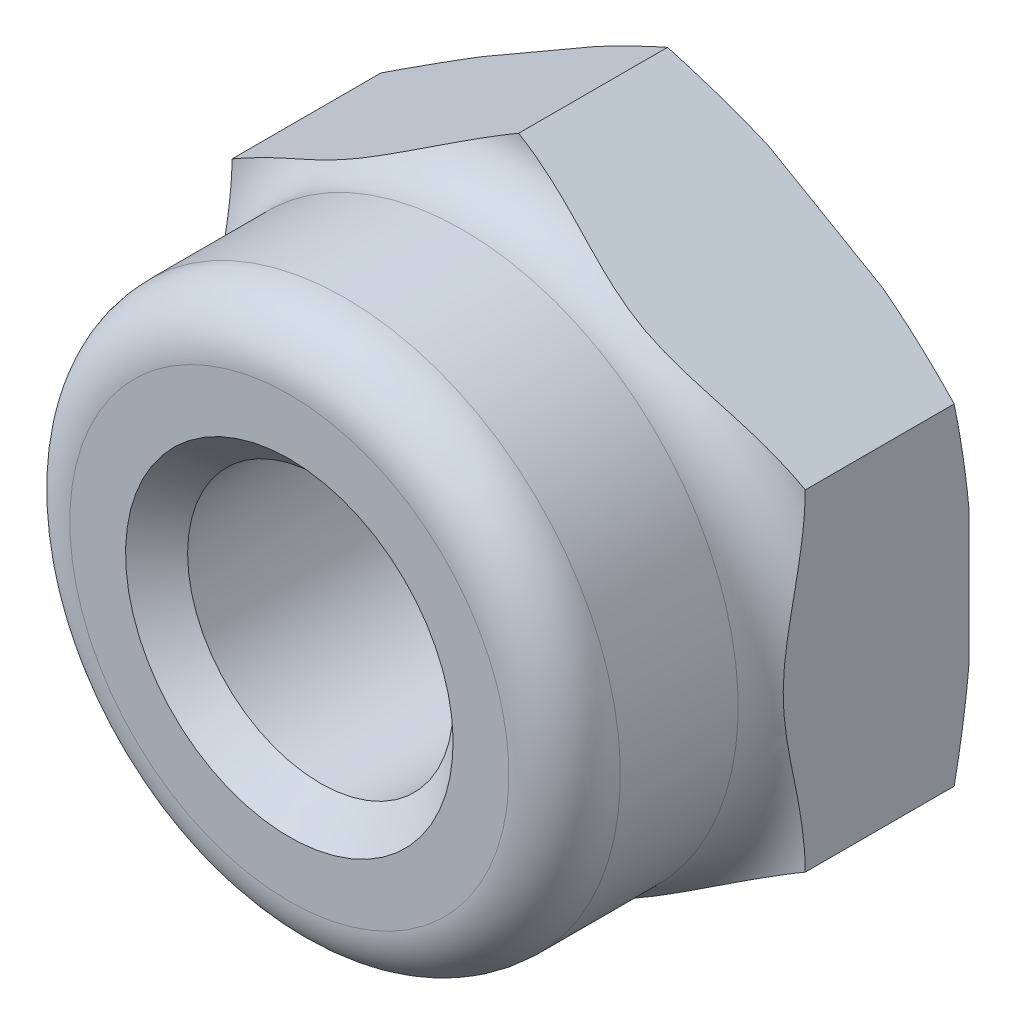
ISO-10303-21;
HEADER;
FILE_DESCRIPTION(('STEP AP214'),'2;1');
FILE_NAME('part.step','',(''),(''),'','','');
FILE_SCHEMA(('AUTOMOTIVE_DESIGN { 1 0 10303 214 1 1 1 1 }'));
ENDSEC;
DATA;
#1=APPLICATION_CONTEXT('core data for automotive mechanical design processes');
#2=APPLICATION_PROTOCOL_DEFINITION('international standard','automotive_design',2000,#1);
#3=PRODUCT_CONTEXT('',#1,'mechanical');
#4=PRODUCT('Part','Part','',(#3));
#5=PRODUCT_RELATED_PRODUCT_CATEGORY('part','',(#4));
#6=PRODUCT_DEFINITION_FORMATION('','',#4);
#7=PRODUCT_DEFINITION_CONTEXT('part definition',#1,'design');
#8=PRODUCT_DEFINITION('design','',#6,#7);
#9=PRODUCT_DEFINITION_SHAPE('','',#8);
#10=(LENGTH_UNIT() NAMED_UNIT(*) SI_UNIT(.MILLI.,.METRE.));
#11=(NAMED_UNIT(*) PLANE_ANGLE_UNIT() SI_UNIT($,.RADIAN.));
#12=(NAMED_UNIT(*) SI_UNIT($,.STERADIAN.) SOLID_ANGLE_UNIT());
#13=UNCERTAINTY_MEASURE_WITH_UNIT(LENGTH_MEASURE(1.E-05),#10,'distance_accuracy_value','');
#14=(GEOMETRIC_REPRESENTATION_CONTEXT(3) GLOBAL_UNCERTAINTY_ASSIGNED_CONTEXT((#13)) GLOBAL_UNIT_ASSIGNED_CONTEXT((#10,
#11,#12)) REPRESENTATION_CONTEXT('',''));
#15=CARTESIAN_POINT('',(0.,0.,0.));
#16=DIRECTION('',(0.,0.,1.));
#17=DIRECTION('',(1.,0.,0.));
#18=AXIS2_PLACEMENT_3D('',#15,#16,#17);
#19=CARTESIAN_POINT('',(0.,0.,0.));
#20=DIRECTION('',(0.,0.,1.));
#21=DIRECTION('',(0.,-1.,0.));
#22=AXIS2_PLACEMENT_3D('',#19,#20,#21);
#23=CONICAL_SURFACE('',#22,3.59248420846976,1.18682389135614);
#24=CARTESIAN_POINT('',(3.5,-5.35752008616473,1.1340897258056));
#25=CARTESIAN_POINT('',(3.5,-5.1994855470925,1.08065060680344));
#26=CARTESIAN_POINT('',(3.5,-5.04124173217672,1.02781903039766));
#27=CARTESIAN_POINT('',(3.5,-4.72422723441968,0.923710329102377));
#28=CARTESIAN_POINT('',(3.5,-4.56545650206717,0.872433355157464));
#29=CARTESIAN_POINT('',(3.5,-4.24693078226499,0.771663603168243));
#30=CARTESIAN_POINT('',(3.5,-4.087174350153,0.72217537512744));
#31=CARTESIAN_POINT('',(3.5,-3.76694274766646,0.625586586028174));
#32=CARTESIAN_POINT('',(3.5,-3.60646759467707,0.578485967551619));
#33=CARTESIAN_POINT('',(3.5,-3.28671067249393,0.487853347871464));
#34=CARTESIAN_POINT('',(3.5,-3.12743965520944,0.444283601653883));
#35=CARTESIAN_POINT('',(3.5,-2.80794259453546,0.36080107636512));
#36=CARTESIAN_POINT('',(3.5,-2.64771659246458,0.320888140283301));
#37=CARTESIAN_POINT('',(3.5,-2.32626591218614,0.245661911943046));
#38=CARTESIAN_POINT('',(3.5,-2.1650417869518,0.210346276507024));
#39=CARTESIAN_POINT('',(3.5,-1.84144674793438,0.145403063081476));
#40=CARTESIAN_POINT('',(3.5,-1.67907591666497,0.115775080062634));
#41=CARTESIAN_POINT('',(3.5,-1.38650646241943,0.0687902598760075));
#42=CARTESIAN_POINT('',(3.5,-1.25651290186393,0.0501630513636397));
#43=CARTESIAN_POINT('',(3.5,-0.995909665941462,0.0179128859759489));
#44=CARTESIAN_POINT('',(3.5,-0.86530004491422,0.00428949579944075));
#45=CARTESIAN_POINT('',(3.5,-0.603697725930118,-0.0174161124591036));
#46=CARTESIAN_POINT('',(3.5,-0.472705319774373,-0.0255018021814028));
#47=CARTESIAN_POINT('',(3.5,-0.210487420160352,-0.0357922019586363));
#48=CARTESIAN_POINT('',(3.5,-0.0792619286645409,-0.0379969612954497));
#49=CARTESIAN_POINT('',(3.5,0.183782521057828,-0.0364198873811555));
#50=CARTESIAN_POINT('',(3.5,0.315601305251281,-0.0326092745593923));
#51=CARTESIAN_POINT('',(3.5,0.578936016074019,-0.0191234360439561));
#52=CARTESIAN_POINT('',(3.5,0.710451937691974,-0.00944811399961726));
#53=CARTESIAN_POINT('',(3.5,0.97304741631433,0.015357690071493));
#54=CARTESIAN_POINT('',(3.5,1.10412663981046,0.0304916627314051));
#55=CARTESIAN_POINT('',(3.5,1.36561720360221,0.0656441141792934));
#56=CARTESIAN_POINT('',(3.5,1.49602854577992,0.0856625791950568));
#57=CARTESIAN_POINT('',(3.5,1.92976729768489,0.159485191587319));
#58=CARTESIAN_POINT('',(3.5,2.23150192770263,0.222714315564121));
#59=CARTESIAN_POINT('',(3.5,2.68127400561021,0.329218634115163));
#60=CARTESIAN_POINT('',(3.5,2.83077741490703,0.366678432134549));
#61=CARTESIAN_POINT('',(3.5,3.12895421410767,0.444776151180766));
#62=CARTESIAN_POINT('',(3.5,3.27762763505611,0.485413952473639));
#63=CARTESIAN_POINT('',(3.5,3.72334509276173,0.611367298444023));
#64=CARTESIAN_POINT('',(3.5,4.01929621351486,0.70052857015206));
#65=CARTESIAN_POINT('',(3.5,4.60897796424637,0.885560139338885));
#66=CARTESIAN_POINT('',(3.5,4.90270914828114,0.981428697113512));
#67=CARTESIAN_POINT('',(3.5,5.48674846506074,1.17713564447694));
#68=CARTESIAN_POINT('',(3.5,5.7770664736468,1.27694469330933));
#69=CARTESIAN_POINT('',(3.5,6.35660167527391,1.47976552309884));
#70=CARTESIAN_POINT('',(3.5,6.64581878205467,1.58277754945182));
#71=CARTESIAN_POINT('',(3.5,7.22148686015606,1.79041128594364));
#72=CARTESIAN_POINT('',(3.5,7.5079433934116,1.89501761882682));
#73=CARTESIAN_POINT('',(3.5,8.08018195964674,2.10594754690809));
#74=CARTESIAN_POINT('',(3.5,8.36596407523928,2.21227091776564));
#75=CARTESIAN_POINT('',(3.5,8.65152038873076,2.31918723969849));
#76=B_SPLINE_CURVE_WITH_KNOTS('',3,(#24,#25,#26,#27,#28,#29,#30,#31,#32,#33,#34,#35,#36,#37,#38,
#39,#40,#41,#42,#43,#44,#45,#46,#47,#48,#49,#50,#51,#52,#53,#54,#55,#56,#57,#58,#59,#60,#61,#62,
#63,#64,#65,#66,#67,#68,#69,#70,#71,#72,#73,#74,#75),.UNSPECIFIED.,.F.,.F.,(4,2,2,2,2,2,2,2,2,2,
2,2,2,2,2,2,2,2,2,2,2,2,2,2,2,4),(0.,0.500479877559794,1.00100819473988,1.50273101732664,
2.00444176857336,2.49977647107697,2.99508989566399,3.49014986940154,3.98517457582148,
4.37905514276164,4.7729015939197,5.16650091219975,5.56009693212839,5.95558176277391,
6.35107309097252,6.74681777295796,7.14256133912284,8.06665276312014,8.52901722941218,
8.99136428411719,9.91849765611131,10.8453914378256,11.7663518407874,12.687382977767,
13.6022530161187,14.5170044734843),.UNSPECIFIED.);
#77=CARTESIAN_POINT('',(3.5,-2.02125,0.181500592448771));
#78=VERTEX_POINT('',#77);
#79=CARTESIAN_POINT('',(3.5,-0.809902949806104,0.));
#80=VERTEX_POINT('',#79);
#81=EDGE_CURVE('E331',#78,#80,#76,.T.);
#82=ORIENTED_EDGE('',*,*,#81,.F.);
#83=CARTESIAN_POINT('',(3.5000002,-2.0212498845,0.181500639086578));
#84=CARTESIAN_POINT('',(3.41316767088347,-2.0713956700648,0.161253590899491));
#85=CARTESIAN_POINT('',(3.32613944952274,-2.12165446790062,0.142089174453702));
#86=CARTESIAN_POINT('',(3.15176901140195,-2.22235339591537,0.106236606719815));
#87=CARTESIAN_POINT('',(3.06442707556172,-2.27279336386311,0.0895466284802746));
#88=CARTESIAN_POINT('',(2.88936668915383,-2.37389073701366,0.0589210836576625));
#89=CARTESIAN_POINT('',(2.80164819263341,-2.42454816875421,0.0449858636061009));
#90=CARTESIAN_POINT('',(2.62582520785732,-2.52608594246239,0.0201446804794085));
#91=CARTESIAN_POINT('',(2.53772048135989,-2.57696642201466,0.00924097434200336));
#92=CARTESIAN_POINT('',(2.44947762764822,-2.62792667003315,-1.99999999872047E-07));
#93=B_SPLINE_CURVE_WITH_KNOTS('',3,(#83,#84,#85,#86,#87,#88,#89,#90,#91,#92),.UNSPECIFIED.,.F.,
.F.,(4,2,2,2,4),(0.,0.306891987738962,0.613556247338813,0.920259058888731,1.22718960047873),.UNSPECIFIED.);
#94=CARTESIAN_POINT('',(2.44947953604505,-2.62792556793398,0.));
#95=VERTEX_POINT('',#94);
#96=EDGE_CURVE('E38',#78,#95,#93,.T.);
#97=ORIENTED_EDGE('',*,*,#96,.T.);
#98=CARTESIAN_POINT('',(0.,0.,0.));
#99=DIRECTION('',(0.,0.,1.));
#100=DIRECTION('',(1.,0.,0.));
#101=AXIS2_PLACEMENT_3D('',#98,#99,#100);
#102=CIRCLE('',#101,3.59248420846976);
#103=EDGE_CURVE('E254',#95,#80,#102,.T.);
#104=ORIENTED_EDGE('',*,*,#103,.T.);
#105=EDGE_LOOP('',(#82,#97,#104));
#106=FACE_BOUND('',#105,.T.);
#107=ADVANCED_FACE('F17',(#106),#23,.T.);
#108=CARTESIAN_POINT('',(3.5,-2.02125,0.));
#109=DIRECTION('',(0.,0.,1.));
#110=DIRECTION('',(1.,0.,0.));
#111=AXIS2_PLACEMENT_3D('',#108,#109,#110);
#112=PLANE('',#111);
#113=CARTESIAN_POINT('',(0.,0.,0.));
#114=DIRECTION('',(0.,0.,1.));
#115=DIRECTION('',(1.,0.,0.));
#116=AXIS2_PLACEMENT_3D('',#113,#114,#115);
#117=CIRCLE('',#116,2.);
#118=CARTESIAN_POINT('',(2.,0.,0.));
#119=VERTEX_POINT('',#118);
#120=EDGE_CURVE('E270',#119,#119,#117,.F.);
#121=ORIENTED_EDGE('',*,*,#120,.F.);
#122=EDGE_LOOP('',(#121));
#123=FACE_BOUND('',#122,.T.);
#124=CARTESIAN_POINT('',(0.,0.,0.));
#125=DIRECTION('',(0.,0.,-1.));
#126=DIRECTION('',(0.,1.,0.));
#127=AXIS2_PLACEMENT_3D('',#124,#125,#126);
#128=CIRCLE('',#127,3.59248420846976);
#129=CARTESIAN_POINT('',(2.44947953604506,2.62792556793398,0.));
#130=VERTEX_POINT('',#129);
#131=CARTESIAN_POINT('',(3.5,0.809902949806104,0.));
#132=VERTEX_POINT('',#131);
#133=EDGE_CURVE('E119',#130,#132,#128,.T.);
#134=ORIENTED_EDGE('',*,*,#133,.T.);
#135=DIRECTION('',(0.,-1.,0.));
#136=VECTOR('',#135,1.);
#137=CARTESIAN_POINT('',(3.5,2.02125,0.));
#138=LINE('',#137,#136);
#139=EDGE_CURVE('E240',#132,#80,#138,.T.);
#140=ORIENTED_EDGE('',*,*,#139,.T.);
#141=ORIENTED_EDGE('',*,*,#103,.F.);
#142=DIRECTION('',(0.865969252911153,0.500097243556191,0.));
#143=VECTOR('',#142,1.);
#144=CARTESIAN_POINT('',(0.,-4.0425,0.));
#145=LINE('',#144,#143);
#146=CARTESIAN_POINT('',(1.05188200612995,-3.43503814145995,0.));
#147=VERTEX_POINT('',#146);
#148=EDGE_CURVE('E249',#147,#95,#145,.T.);
#149=ORIENTED_EDGE('',*,*,#148,.F.);
#150=CARTESIAN_POINT('',(-1.05188200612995,-3.43503814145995,0.));
#151=VERTEX_POINT('',#150);
#152=EDGE_CURVE('E269',#151,#147,#102,.T.);
#153=ORIENTED_EDGE('',*,*,#152,.F.);
#154=DIRECTION('',(0.865969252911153,-0.500097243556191,0.));
#155=VECTOR('',#154,1.);
#156=CARTESIAN_POINT('',(-3.5,-2.02125,0.));
#157=LINE('',#156,#155);
#158=CARTESIAN_POINT('',(-2.44947953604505,-2.62792556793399,0.));
#159=VERTEX_POINT('',#158);
#160=EDGE_CURVE('E247',#159,#151,#157,.T.);
#161=ORIENTED_EDGE('',*,*,#160,.F.);
#162=CARTESIAN_POINT('',(-3.5,-0.809902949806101,0.));
#163=VERTEX_POINT('',#162);
#164=EDGE_CURVE('E310',#163,#159,#102,.T.);
#165=ORIENTED_EDGE('',*,*,#164,.F.);
#166=DIRECTION('',(0.,-1.,0.));
#167=VECTOR('',#166,1.);
#168=CARTESIAN_POINT('',(-3.5,2.02125,0.));
#169=LINE('',#168,#167);
#170=CARTESIAN_POINT('',(-3.5,0.809902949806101,0.));
#171=VERTEX_POINT('',#170);
#172=EDGE_CURVE('E244',#171,#163,#169,.T.);
#173=ORIENTED_EDGE('',*,*,#172,.F.);
#174=CARTESIAN_POINT('',(-2.44947953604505,2.62792556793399,0.));
#175=VERTEX_POINT('',#174);
#176=EDGE_CURVE('E312',#175,#171,#102,.T.);
#177=ORIENTED_EDGE('',*,*,#176,.F.);
#178=DIRECTION('',(-0.865969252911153,-0.500097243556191,0.));
#179=VECTOR('',#178,1.);
#180=CARTESIAN_POINT('',(0.,4.0425,0.));
#181=LINE('',#180,#179);
#182=CARTESIAN_POINT('',(-1.05188200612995,3.43503814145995,0.));
#183=VERTEX_POINT('',#182);
#184=EDGE_CURVE('E126',#183,#175,#181,.T.);
#185=ORIENTED_EDGE('',*,*,#184,.F.);
#186=CARTESIAN_POINT('',(1.05188200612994,3.43503814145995,0.));
#187=VERTEX_POINT('',#186);
#188=EDGE_CURVE('E122',#187,#183,#102,.T.);
#189=ORIENTED_EDGE('',*,*,#188,.F.);
#190=DIRECTION('',(-0.865969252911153,0.500097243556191,0.));
#191=VECTOR('',#190,1.);
#192=CARTESIAN_POINT('',(3.5,2.02125,0.));
#193=LINE('',#192,#191);
#194=EDGE_CURVE('E115',#130,#187,#193,.T.);
#195=ORIENTED_EDGE('',*,*,#194,.F.);
#196=EDGE_LOOP('',(#134,#140,#141,#149,#153,#161,#165,#173,#177,#185,#189,#195));
#197=FACE_BOUND('',#196,.T.);
#198=ADVANCED_FACE('F117',(#123,#197),#112,.F.);
#199=CARTESIAN_POINT('',(3.5,2.02125,4.8));
#200=DIRECTION('',(-0.500097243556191,-0.865969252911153,0.));
#201=DIRECTION('',(0.865969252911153,-0.500097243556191,0.));
#202=AXIS2_PLACEMENT_3D('',#199,#200,#201);
#203=PLANE('',#202);
#204=CARTESIAN_POINT('',(2.44947762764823,2.62792667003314,-1.99999999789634E-07));
#205=CARTESIAN_POINT('',(2.53772048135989,2.57696642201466,0.00924097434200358));
#206=CARTESIAN_POINT('',(2.62582520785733,2.52608594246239,0.0201446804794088));
#207=CARTESIAN_POINT('',(2.80164819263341,2.4245481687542,0.0449858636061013));
#208=CARTESIAN_POINT('',(2.88936668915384,2.37389073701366,0.0589210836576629));
#209=CARTESIAN_POINT('',(3.06442707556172,2.27279336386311,0.0895466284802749));
#210=CARTESIAN_POINT('',(3.15176901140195,2.22235339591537,0.106236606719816));
#211=CARTESIAN_POINT('',(3.32613944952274,2.12165446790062,0.142089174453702));
#212=CARTESIAN_POINT('',(3.41316767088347,2.0713956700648,0.161253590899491));
#213=CARTESIAN_POINT('',(3.5000002,2.0212498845,0.181500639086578));
#214=B_SPLINE_CURVE_WITH_KNOTS('',3,(#204,#205,#206,#207,#208,#209,#210,#211,#212,#213),
.UNSPECIFIED.,.F.,.F.,(4,2,2,2,4),(0.,0.306930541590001,0.613633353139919,0.920297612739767,
1.22718960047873),.UNSPECIFIED.);
#215=CARTESIAN_POINT('',(3.5,2.02125,0.18150059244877));
#216=VERTEX_POINT('',#215);
#217=EDGE_CURVE('E130',#130,#216,#214,.T.);
#218=ORIENTED_EDGE('',*,*,#217,.F.);
#219=ORIENTED_EDGE('',*,*,#194,.T.);
#220=CARTESIAN_POINT('',(-1.99999999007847E-07,4.0425001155,0.181818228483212));
#221=CARTESIAN_POINT('',(0.0869438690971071,3.99228991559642,0.161533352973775));
#222=CARTESIAN_POINT('',(0.174084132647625,3.941966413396,0.142333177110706));
#223=CARTESIAN_POINT('',(0.348679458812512,3.84113761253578,0.106414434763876));
#224=CARTESIAN_POINT('',(0.43613423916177,3.79063247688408,0.089694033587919));
#225=CARTESIAN_POINT('',(0.611421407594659,3.68940413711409,0.0590140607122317));
#226=CARTESIAN_POINT('',(0.699253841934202,3.638680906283,0.0450548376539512));
#227=CARTESIAN_POINT('',(0.875305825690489,3.53701088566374,0.0201731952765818));
#228=CARTESIAN_POINT('',(0.963525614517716,3.48606395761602,0.00925304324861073));
#229=CARTESIAN_POINT('',(1.05188391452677,3.43503703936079,-2.00000000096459E-07));
#230=B_SPLINE_CURVE_WITH_KNOTS('',3,(#220,#221,#222,#223,#224,#225,#226,#227,#228,#229),
.UNSPECIFIED.,.F.,.F.,(4,2,2,2,4),(0.,0.307293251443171,0.61435800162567,0.921461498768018,
1.22879349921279),.UNSPECIFIED.);
#231=CARTESIAN_POINT('',(0.,4.0425,0.181818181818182));
#232=VERTEX_POINT('',#231);
#233=EDGE_CURVE('E139',#232,#187,#230,.T.);
#234=ORIENTED_EDGE('',*,*,#233,.F.);
#235=DIRECTION('',(0.,0.,-1.));
#236=VECTOR('',#235,1.);
#237=CARTESIAN_POINT('',(0.,4.0425,4.8));
#238=LINE('',#237,#236);
#239=CARTESIAN_POINT('',(0.,4.0425,2.));
#240=VERTEX_POINT('',#239);
#241=EDGE_CURVE('E263',#240,#232,#238,.T.);
#242=ORIENTED_EDGE('',*,*,#241,.F.);
#243=CARTESIAN_POINT('',(-1.99999999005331E-07,4.0425001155,2.));
#244=CARTESIAN_POINT('',(0.0490456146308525,4.01417615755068,2.00001163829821));
#245=CARTESIAN_POINT('',(0.0980611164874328,3.98586970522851,2.00176574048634));
#246=CARTESIAN_POINT('',(0.195902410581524,3.92936635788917,2.00818376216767));
#247=CARTESIAN_POINT('',(0.244728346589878,3.90116937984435,2.01284467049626));
#248=CARTESIAN_POINT('',(0.390340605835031,3.81707830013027,2.03026842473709));
#249=CARTESIAN_POINT('',(0.486806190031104,3.76136942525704,2.04648524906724));
#250=CARTESIAN_POINT('',(0.678853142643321,3.65046231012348,2.084192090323));
#251=CARTESIAN_POINT('',(0.774434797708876,3.59526390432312,2.10568033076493));
#252=CARTESIAN_POINT('',(0.965575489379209,3.48488015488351,2.14990481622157));
#253=CARTESIAN_POINT('',(1.06113409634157,3.42969505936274,2.17264347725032));
#254=CARTESIAN_POINT('',(1.23606965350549,3.32866977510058,2.21049535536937));
#255=CARTESIAN_POINT('',(1.31533672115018,3.28289304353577,2.22624634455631));
#256=CARTESIAN_POINT('',(1.47453895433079,3.19095375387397,2.25129520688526));
#257=CARTESIAN_POINT('',(1.55447218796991,3.14479231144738,2.2606076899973));
#258=CARTESIAN_POINT('',(1.67466785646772,3.07537931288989,2.26751746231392));
#259=CARTESIAN_POINT('',(1.71477973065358,3.05221470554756,2.26864438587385));
#260=CARTESIAN_POINT('',(1.79499960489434,3.00588772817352,2.26847504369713));
#261=CARTESIAN_POINT('',(1.83510760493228,2.98272535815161,2.26717876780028));
#262=CARTESIAN_POINT('',(1.95538338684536,2.91326609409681,2.25978214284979));
#263=CARTESIAN_POINT('',(2.03539077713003,2.86706182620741,2.25016784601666));
#264=CARTESIAN_POINT('',(2.17221666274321,2.7880448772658,2.22823434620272));
#265=CARTESIAN_POINT('',(2.22924068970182,2.7551135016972,2.21743179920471));
#266=CARTESIAN_POINT('',(2.34300808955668,2.68941282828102,2.19397517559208));
#267=CARTESIAN_POINT('',(2.39975141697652,2.65664355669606,2.18132080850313));
#268=CARTESIAN_POINT('',(2.51309207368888,2.59118932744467,2.15536800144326));
#269=CARTESIAN_POINT('',(2.56968946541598,2.55850433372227,2.14206991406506));
#270=CARTESIAN_POINT('',(2.68294643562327,2.49309843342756,2.11584715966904));
#271=CARTESIAN_POINT('',(2.73960601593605,2.46037752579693,2.10292250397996));
#272=CARTESIAN_POINT('',(2.91218701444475,2.36071199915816,2.0655544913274));
#273=CARTESIAN_POINT('',(3.02847894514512,2.29355340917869,2.04310543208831));
#274=CARTESIAN_POINT('',(3.20422502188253,2.19206004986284,2.01857479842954));
#275=CARTESIAN_POINT('',(3.26317277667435,2.15801772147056,2.01191668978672));
#276=CARTESIAN_POINT('',(3.38139367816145,2.08974515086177,2.00265865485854));
#277=CARTESIAN_POINT('',(3.44066719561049,2.05551469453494,2.00006526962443));
#278=CARTESIAN_POINT('',(3.5000002,2.0212498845,2.00000045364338));
#279=B_SPLINE_CURVE_WITH_KNOTS('',3,(#243,#244,#245,#246,#247,#248,#249,#250,#251,#252,#253,
#254,#255,#256,#257,#258,#259,#260,#261,#262,#263,#264,#265,#266,#267,#268,#269,#270,#271,#272,
#273,#274,#275,#276,#277,#278),.UNSPECIFIED.,.F.,.F.,(4,2,2,2,2,2,2,2,2,2,2,2,2,2,2,2,2,4),(0.,
0.169833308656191,0.339490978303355,0.676925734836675,1.01424693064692,1.35224449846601,
1.63079652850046,1.90871438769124,2.04765501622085,2.18659622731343,2.46486569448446,
2.66502992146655,2.86522557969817,3.06531279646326,3.26540607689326,3.67352393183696,
3.87860170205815,4.08400915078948),.UNSPECIFIED.);
#280=CARTESIAN_POINT('',(3.5,2.02125,2.00000045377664));
#281=VERTEX_POINT('',#280);
#282=EDGE_CURVE('E11',#240,#281,#279,.T.);
#283=ORIENTED_EDGE('',*,*,#282,.T.);
#284=DIRECTION('',(0.,0.,-1.));
#285=VECTOR('',#284,1.);
#286=CARTESIAN_POINT('',(3.5,2.02125,4.8));
#287=LINE('',#286,#285);
#288=EDGE_CURVE('E125',#281,#216,#287,.T.);
#289=ORIENTED_EDGE('',*,*,#288,.T.);
#290=EDGE_LOOP('',(#218,#219,#234,#242,#283,#289));
#291=FACE_BOUND('',#290,.T.);
#292=ADVANCED_FACE('F131',(#291),#203,.F.);
#293=CARTESIAN_POINT('',(0.,4.0425,4.8));
#294=DIRECTION('',(0.500097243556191,-0.865969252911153,0.));
#295=DIRECTION('',(0.865969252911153,0.500097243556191,0.));
#296=AXIS2_PLACEMENT_3D('',#293,#294,#295);
#297=PLANE('',#296);
#298=CARTESIAN_POINT('',(-1.05188391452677,3.43503703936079,-1.99999999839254E-07));
#299=CARTESIAN_POINT('',(-0.963525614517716,3.48606395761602,0.0092530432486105));
#300=CARTESIAN_POINT('',(-0.875305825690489,3.53701088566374,0.0201731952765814));
#301=CARTESIAN_POINT('',(-0.699253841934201,3.638680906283,0.045054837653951));
#302=CARTESIAN_POINT('',(-0.611421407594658,3.68940413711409,0.0590140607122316));
#303=CARTESIAN_POINT('',(-0.436134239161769,3.79063247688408,0.0896940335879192));
#304=CARTESIAN_POINT('',(-0.348679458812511,3.84113761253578,0.106414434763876));
#305=CARTESIAN_POINT('',(-0.174084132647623,3.941966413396,0.142333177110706));
#306=CARTESIAN_POINT('',(-0.0869438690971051,3.99228991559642,0.161533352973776));
#307=CARTESIAN_POINT('',(2.00000000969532E-07,4.0425001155,0.181818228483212));
#308=B_SPLINE_CURVE_WITH_KNOTS('',3,(#298,#299,#300,#301,#302,#303,#304,#305,#306,#307),
.UNSPECIFIED.,.F.,.F.,(4,2,2,2,4),(0.,0.307332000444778,0.614435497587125,0.921500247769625,
1.2287934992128),.UNSPECIFIED.);
#309=EDGE_CURVE('E136',#183,#232,#308,.T.);
#310=ORIENTED_EDGE('',*,*,#309,.F.);
#311=ORIENTED_EDGE('',*,*,#184,.T.);
#312=CARTESIAN_POINT('',(-3.5000002,2.0212498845,0.181500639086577));
#313=CARTESIAN_POINT('',(-3.41316767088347,2.0713956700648,0.161253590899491));
#314=CARTESIAN_POINT('',(-3.32613944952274,2.12165446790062,0.142089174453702));
#315=CARTESIAN_POINT('',(-3.15176901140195,2.22235339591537,0.106236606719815));
#316=CARTESIAN_POINT('',(-3.06442707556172,2.27279336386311,0.0895466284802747));
#317=CARTESIAN_POINT('',(-2.88936668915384,2.37389073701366,0.0589210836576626));
#318=CARTESIAN_POINT('',(-2.80164819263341,2.4245481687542,0.0449858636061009));
#319=CARTESIAN_POINT('',(-2.62582520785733,2.52608594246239,0.0201446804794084));
#320=CARTESIAN_POINT('',(-2.53772048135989,2.57696642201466,0.00924097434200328));
#321=CARTESIAN_POINT('',(-2.44947762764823,2.62792667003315,-2.00000000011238E-07));
#322=B_SPLINE_CURVE_WITH_KNOTS('',3,(#312,#313,#314,#315,#316,#317,#318,#319,#320,#321),
.UNSPECIFIED.,.F.,.F.,(4,2,2,2,4),(0.,0.306891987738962,0.61355624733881,0.920259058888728,
1.22718960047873),.UNSPECIFIED.);
#323=CARTESIAN_POINT('',(-3.5,2.02125,0.18150059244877));
#324=VERTEX_POINT('',#323);
#325=EDGE_CURVE('E185',#324,#175,#322,.T.);
#326=ORIENTED_EDGE('',*,*,#325,.F.);
#327=DIRECTION('',(0.,0.,-1.));
#328=VECTOR('',#327,1.);
#329=CARTESIAN_POINT('',(-3.5,2.02125,4.8));
#330=LINE('',#329,#328);
#331=CARTESIAN_POINT('',(-3.5,2.02125,2.00000045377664));
#332=VERTEX_POINT('',#331);
#333=EDGE_CURVE('E260',#332,#324,#330,.T.);
#334=ORIENTED_EDGE('',*,*,#333,.F.);
#335=CARTESIAN_POINT('',(-3.5000002,2.0212498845,2.00000045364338));
#336=CARTESIAN_POINT('',(-3.45085349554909,2.0496321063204,2.00004488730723));
#337=CARTESIAN_POINT('',(-3.40173809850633,2.07799624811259,2.00183584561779));
#338=CARTESIAN_POINT('',(-3.30369894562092,2.13461385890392,2.00833285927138));
#339=CARTESIAN_POINT('',(-3.25477504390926,2.1628674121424,2.01303589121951));
#340=CARTESIAN_POINT('',(-3.1088681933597,2.24712861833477,2.03058979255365));
#341=CARTESIAN_POINT('',(-3.01220814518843,2.30294979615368,2.04689874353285));
#342=CARTESIAN_POINT('',(-2.81977433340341,2.41408032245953,2.084777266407));
#343=CARTESIAN_POINT('',(-2.72400026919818,2.46938984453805,2.10634498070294));
#344=CARTESIAN_POINT('',(-2.53247034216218,2.57999837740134,2.15068445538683));
#345=CARTESIAN_POINT('',(-2.43671488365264,2.6352971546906,2.17345849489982));
#346=CARTESIAN_POINT('',(-2.26235247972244,2.73599144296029,2.21108486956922));
#347=CARTESIAN_POINT('',(-2.18386331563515,2.7813189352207,2.22662290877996));
#348=CARTESIAN_POINT('',(-2.02622735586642,2.87235370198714,2.25135258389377));
#349=CARTESIAN_POINT('',(-1.94708239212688,2.91805991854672,2.26055813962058));
#350=CARTESIAN_POINT('',(-1.82807404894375,2.98678723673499,2.26745722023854));
#351=CARTESIAN_POINT('',(-1.7883589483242,3.00972270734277,2.26860553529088));
#352=CARTESIAN_POINT('',(-1.70892972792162,3.05559308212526,2.26852068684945));
#353=CARTESIAN_POINT('',(-1.66921560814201,3.07852798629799,2.26728751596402));
#354=CARTESIAN_POINT('',(-1.58983450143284,3.12437057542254,2.26254633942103));
#355=CARTESIAN_POINT('',(-1.55016766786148,3.14727817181,2.25903501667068));
#356=CARTESIAN_POINT('',(-1.47099906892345,3.19299803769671,2.25004722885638));
#357=CARTESIAN_POINT('',(-1.43149733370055,3.21581028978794,2.24457041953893));
#358=CARTESIAN_POINT('',(-1.33456586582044,3.2717882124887,2.22919709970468));
#359=CARTESIAN_POINT('',(-1.27724236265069,3.30489253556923,2.21842623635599));
#360=CARTESIAN_POINT('',(-1.16289662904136,3.37092719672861,2.1949683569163));
#361=CARTESIAN_POINT('',(-1.10587444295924,3.40385750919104,2.18228106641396));
#362=CARTESIAN_POINT('',(-0.991972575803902,3.46963583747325,2.15623106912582));
#363=CARTESIAN_POINT('',(-0.935092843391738,3.50248388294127,2.14286865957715));
#364=CARTESIAN_POINT('',(-0.821274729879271,3.56821384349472,2.11650280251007));
#365=CARTESIAN_POINT('',(-0.764336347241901,3.6010957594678,2.10349936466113));
#366=CARTESIAN_POINT('',(-0.590872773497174,3.70127097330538,2.06588660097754));
#367=CARTESIAN_POINT('',(-0.473975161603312,3.76877934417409,2.04327516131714));
#368=CARTESIAN_POINT('',(-0.29731235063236,3.87080211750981,2.01859069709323));
#369=CARTESIAN_POINT('',(-0.238059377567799,3.9050207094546,2.0118963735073));
#370=CARTESIAN_POINT('',(-0.119224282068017,3.97364797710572,2.00261060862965));
#371=CARTESIAN_POINT('',(-0.0596417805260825,4.00805687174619,2.0000258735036));
#372=CARTESIAN_POINT('',(2.00000001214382E-07,4.0425001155,2.));
#373=B_SPLINE_CURVE_WITH_KNOTS('',3,(#335,#336,#337,#338,#339,#340,#341,#342,#343,#344,#345,
#346,#347,#348,#349,#350,#351,#352,#353,#354,#355,#356,#357,#358,#359,#360,#361,#362,#363,#364,
#365,#366,#367,#368,#369,#370,#371,#372),.UNSPECIFIED.,.F.,.F.,(4,2,2,2,2,2,2,2,2,2,2,2,2,2,2,2,
2,2,4),(0.,0.170182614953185,0.340188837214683,0.678330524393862,1.0163529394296,
1.35503849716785,1.63082679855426,1.90600691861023,2.04357744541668,2.18114839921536,
2.31892011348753,2.4567159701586,2.65785704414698,2.85902694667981,3.06010903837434,
3.26119654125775,3.67146050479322,3.87759934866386,4.08407423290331),.UNSPECIFIED.);
#374=EDGE_CURVE('E327',#332,#240,#373,.T.);
#375=ORIENTED_EDGE('',*,*,#374,.T.);
#376=ORIENTED_EDGE('',*,*,#241,.T.);
#377=EDGE_LOOP('',(#310,#311,#326,#334,#375,#376));
#378=FACE_BOUND('',#377,.T.);
#379=ADVANCED_FACE('F325',(#378),#297,.F.);
#380=CARTESIAN_POINT('',(-3.5,2.02125,4.8));
#381=DIRECTION('',(1.,0.,0.));
#382=DIRECTION('',(0.,0.,-1.));
#383=AXIS2_PLACEMENT_3D('',#380,#381,#382);
#384=PLANE('',#383);
#385=CARTESIAN_POINT('',(-3.5,-5.35752008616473,1.1340897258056));
#386=CARTESIAN_POINT('',(-3.5,-5.1994855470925,1.08065060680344));
#387=CARTESIAN_POINT('',(-3.5,-5.04124173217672,1.02781903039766));
#388=CARTESIAN_POINT('',(-3.5,-4.72422723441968,0.923710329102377));
#389=CARTESIAN_POINT('',(-3.5,-4.56545650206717,0.872433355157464));
#390=CARTESIAN_POINT('',(-3.5,-4.24693078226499,0.771663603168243));
#391=CARTESIAN_POINT('',(-3.5,-4.087174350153,0.72217537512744));
#392=CARTESIAN_POINT('',(-3.5,-3.76694274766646,0.625586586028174));
#393=CARTESIAN_POINT('',(-3.5,-3.60646759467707,0.578485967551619));
#394=CARTESIAN_POINT('',(-3.5,-3.28671067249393,0.487853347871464));
#395=CARTESIAN_POINT('',(-3.5,-3.12743965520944,0.444283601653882));
#396=CARTESIAN_POINT('',(-3.5,-2.80794259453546,0.36080107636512));
#397=CARTESIAN_POINT('',(-3.5,-2.64771659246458,0.320888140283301));
#398=CARTESIAN_POINT('',(-3.5,-2.32626591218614,0.245661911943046));
#399=CARTESIAN_POINT('',(-3.5,-2.1650417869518,0.210346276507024));
#400=CARTESIAN_POINT('',(-3.5,-1.84144674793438,0.145403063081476));
#401=CARTESIAN_POINT('',(-3.5,-1.67907591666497,0.115775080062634));
#402=CARTESIAN_POINT('',(-3.5,-1.38650646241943,0.0687902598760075));
#403=CARTESIAN_POINT('',(-3.5,-1.25651290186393,0.0501630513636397));
#404=CARTESIAN_POINT('',(-3.5,-0.995909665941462,0.017912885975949));
#405=CARTESIAN_POINT('',(-3.5,-0.86530004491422,0.00428949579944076));
#406=CARTESIAN_POINT('',(-3.5,-0.603697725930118,-0.0174161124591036));
#407=CARTESIAN_POINT('',(-3.5,-0.472705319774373,-0.0255018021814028));
#408=CARTESIAN_POINT('',(-3.5,-0.210487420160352,-0.0357922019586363));
#409=CARTESIAN_POINT('',(-3.5,-0.079261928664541,-0.0379969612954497));
#410=CARTESIAN_POINT('',(-3.5,0.183782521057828,-0.0364198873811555));
#411=CARTESIAN_POINT('',(-3.5,0.315601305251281,-0.0326092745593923));
#412=CARTESIAN_POINT('',(-3.5,0.578936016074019,-0.0191234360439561));
#413=CARTESIAN_POINT('',(-3.5,0.710451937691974,-0.00944811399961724));
#414=CARTESIAN_POINT('',(-3.5,0.97304741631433,0.015357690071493));
#415=CARTESIAN_POINT('',(-3.5,1.10412663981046,0.030491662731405));
#416=CARTESIAN_POINT('',(-3.5,1.36561720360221,0.0656441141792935));
#417=CARTESIAN_POINT('',(-3.5,1.49602854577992,0.0856625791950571));
#418=CARTESIAN_POINT('',(-3.5,1.92976729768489,0.15948519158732));
#419=CARTESIAN_POINT('',(-3.5,2.23150192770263,0.22271431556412));
#420=CARTESIAN_POINT('',(-3.5,2.68127400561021,0.329218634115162));
#421=CARTESIAN_POINT('',(-3.5,2.83077741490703,0.366678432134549));
#422=CARTESIAN_POINT('',(-3.5,3.12895421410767,0.444776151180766));
#423=CARTESIAN_POINT('',(-3.5,3.27762763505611,0.485413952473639));
#424=CARTESIAN_POINT('',(-3.5,3.72334509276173,0.611367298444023));
#425=CARTESIAN_POINT('',(-3.5,4.01929621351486,0.700528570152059));
#426=CARTESIAN_POINT('',(-3.5,4.60897796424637,0.885560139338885));
#427=CARTESIAN_POINT('',(-3.5,4.90270914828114,0.981428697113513));
#428=CARTESIAN_POINT('',(-3.5,5.48674846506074,1.17713564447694));
#429=CARTESIAN_POINT('',(-3.5,5.7770664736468,1.27694469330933));
#430=CARTESIAN_POINT('',(-3.5,6.35660167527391,1.47976552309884));
#431=CARTESIAN_POINT('',(-3.5,6.64581878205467,1.58277754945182));
#432=CARTESIAN_POINT('',(-3.5,7.22148686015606,1.79041128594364));
#433=CARTESIAN_POINT('',(-3.5,7.5079433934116,1.89501761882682));
#434=CARTESIAN_POINT('',(-3.5,8.08018195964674,2.10594754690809));
#435=CARTESIAN_POINT('',(-3.5,8.36596407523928,2.21227091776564));
#436=CARTESIAN_POINT('',(-3.5,8.65152038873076,2.31918723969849));
#437=B_SPLINE_CURVE_WITH_KNOTS('',3,(#385,#386,#387,#388,#389,#390,#391,#392,#393,#394,#395,
#396,#397,#398,#399,#400,#401,#402,#403,#404,#405,#406,#407,#408,#409,#410,#411,#412,#413,#414,
#415,#416,#417,#418,#419,#420,#421,#422,#423,#424,#425,#426,#427,#428,#429,#430,#431,#432,#433,
#434,#435,#436),.UNSPECIFIED.,.F.,.F.,(4,2,2,2,2,2,2,2,2,2,2,2,2,2,2,2,2,2,2,2,2,2,2,2,2,4),(0.,
0.500479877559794,1.00100819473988,1.50273101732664,2.00444176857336,2.49977647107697,
2.99508989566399,3.49014986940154,3.98517457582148,4.37905514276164,4.7729015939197,
5.16650091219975,5.56009693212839,5.95558176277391,6.35107309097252,6.74681777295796,
7.14256133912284,8.06665276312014,8.52901722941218,8.99136428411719,9.91849765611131,
10.8453914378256,11.7663518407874,12.687382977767,13.6022530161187,14.5170044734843),.UNSPECIFIED.);
#438=CARTESIAN_POINT('',(-3.5,-2.02125,0.181500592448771));
#439=VERTEX_POINT('',#438);
#440=EDGE_CURVE('E351',#439,#163,#437,.T.);
#441=ORIENTED_EDGE('',*,*,#440,.F.);
#442=DIRECTION('',(0.,0.,-1.));
#443=VECTOR('',#442,1.);
#444=CARTESIAN_POINT('',(-3.5,-2.02125,4.8));
#445=LINE('',#444,#443);
#446=CARTESIAN_POINT('',(-3.5,-2.02125,2.00000045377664));
#447=VERTEX_POINT('',#446);
#448=EDGE_CURVE('E257',#447,#439,#445,.T.);
#449=ORIENTED_EDGE('',*,*,#448,.F.);
#450=CARTESIAN_POINT('',(-3.5,0.,2.26946029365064));
#451=CARTESIAN_POINT('',(-3.5,0.0510746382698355,2.26945925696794));
#452=CARTESIAN_POINT('',(-3.5,0.102150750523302,2.26797003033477));
#453=CARTESIAN_POINT('',(-3.5,0.204144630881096,2.26219143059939));
#454=CARTESIAN_POINT('',(-3.5,0.255062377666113,2.25790169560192));
#455=CARTESIAN_POINT('',(-3.5,0.407625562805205,2.24149224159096));
#456=CARTESIAN_POINT('',(-3.5,0.508874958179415,2.22583535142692));
#457=CARTESIAN_POINT('',(-3.5,0.712380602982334,2.18969458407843));
#458=CARTESIAN_POINT('',(-3.5,0.814619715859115,2.16912507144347));
#459=CARTESIAN_POINT('',(-3.5,1.01895522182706,2.12783269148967));
#460=CARTESIAN_POINT('',(-3.5,1.12105164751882,2.10711001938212));
#461=CARTESIAN_POINT('',(-3.5,1.32615155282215,2.0688794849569));
#462=CARTESIAN_POINT('',(-3.5,1.42915670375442,2.05138014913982));
#463=CARTESIAN_POINT('',(-3.5,1.6362840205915,2.02276975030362));
#464=CARTESIAN_POINT('',(-3.5,1.74040765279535,2.01166848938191));
#465=CARTESIAN_POINT('',(-3.5,1.94773781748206,1.99934430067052));
#466=CARTESIAN_POINT('',(-3.5,2.05093438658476,1.99797444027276));
#467=CARTESIAN_POINT('',(-3.5,2.25653265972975,2.00864890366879));
#468=CARTESIAN_POINT('',(-3.5,2.35893589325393,2.02064298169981));
#469=CARTESIAN_POINT('',(-3.5,2.52169445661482,2.05510235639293));
#470=CARTESIAN_POINT('',(-3.5,2.58323703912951,2.07185449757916));
#471=CARTESIAN_POINT('',(-3.5,2.70335232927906,2.11415757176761));
#472=CARTESIAN_POINT('',(-3.5,2.76192713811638,2.13970217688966));
#473=CARTESIAN_POINT('',(-3.5,2.85377304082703,2.19057359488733));
#474=CARTESIAN_POINT('',(-3.5,2.88872635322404,2.21284892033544));
#475=CARTESIAN_POINT('',(-3.5,2.95496379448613,2.26235041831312));
#476=CARTESIAN_POINT('',(-3.5,2.9862528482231,2.28956981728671));
#477=CARTESIAN_POINT('',(-3.5,3.03713947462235,2.34258064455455));
#478=CARTESIAN_POINT('',(-3.5,3.0577917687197,2.36735375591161));
#479=CARTESIAN_POINT('',(-3.5,3.09482871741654,2.4199209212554));
#480=CARTESIAN_POINT('',(-3.5,3.11121869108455,2.44771114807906));
#481=CARTESIAN_POINT('',(-3.5,3.13646320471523,2.50122557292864));
#482=CARTESIAN_POINT('',(-3.5,3.14610045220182,2.52657881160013));
#483=CARTESIAN_POINT('',(-3.5,3.16099086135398,2.57854823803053));
#484=CARTESIAN_POINT('',(-3.5,3.1662463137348,2.60516375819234));
#485=CARTESIAN_POINT('',(-3.5,3.17200827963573,2.65899038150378));
#486=CARTESIAN_POINT('',(-3.5,3.17250074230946,2.68620300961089));
#487=CARTESIAN_POINT('',(-3.5,3.16866222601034,2.74028369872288));
#488=CARTESIAN_POINT('',(-3.5,3.16433086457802,2.76715173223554));
#489=CARTESIAN_POINT('',(-3.5,3.15145925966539,2.81856977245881));
#490=CARTESIAN_POINT('',(-3.5,3.14311511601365,2.84316972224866));
#491=CARTESIAN_POINT('',(-3.5,3.1228105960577,2.89081629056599));
#492=CARTESIAN_POINT('',(-3.5,3.11084887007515,2.91386232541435));
#493=CARTESIAN_POINT('',(-3.5,3.07871948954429,2.96653628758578));
#494=CARTESIAN_POINT('',(-3.5,3.05716251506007,2.99531740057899));
#495=CARTESIAN_POINT('',(-3.5,3.00967809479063,3.04900693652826));
#496=CARTESIAN_POINT('',(-3.5,2.98374221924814,3.0739077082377));
#497=CARTESIAN_POINT('',(-3.5,2.91685434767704,3.12981000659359));
#498=CARTESIAN_POINT('',(-3.5,2.87424580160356,3.15882055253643));
#499=CARTESIAN_POINT('',(-3.5,2.78506684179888,3.20986183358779));
#500=CARTESIAN_POINT('',(-3.5,2.73848827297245,3.23187773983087));
#501=CARTESIAN_POINT('',(-3.5,2.61315379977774,3.28176910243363));
#502=CARTESIAN_POINT('',(-3.5,2.53245797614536,3.30472665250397));
#503=CARTESIAN_POINT('',(-3.5,2.36874993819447,3.33845352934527));
#504=CARTESIAN_POINT('',(-3.5,2.28573561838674,3.34921138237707));
#505=CARTESIAN_POINT('',(-3.5,2.11418796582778,3.36177549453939));
#506=CARTESIAN_POINT('',(-3.5,2.0256174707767,3.36301739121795));
#507=CARTESIAN_POINT('',(-3.5,1.84867015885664,3.357699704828));
#508=CARTESIAN_POINT('',(-3.5,1.760293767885,3.35112953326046));
#509=CARTESIAN_POINT('',(-3.5,1.583463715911,3.33226344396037));
#510=CARTESIAN_POINT('',(-3.5,1.49501533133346,3.3199211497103));
#511=CARTESIAN_POINT('',(-3.5,1.31879830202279,3.29148843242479));
#512=CARTESIAN_POINT('',(-3.5,1.23102932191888,3.27539999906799));
#513=CARTESIAN_POINT('',(-3.5,1.03542908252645,3.23748075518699));
#514=CARTESIAN_POINT('',(-3.5,0.927693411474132,3.2151858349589));
#515=CARTESIAN_POINT('',(-3.5,0.711799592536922,3.17219749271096));
#516=CARTESIAN_POINT('',(-3.5,0.603641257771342,3.15150489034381));
#517=CARTESIAN_POINT('',(-3.5,0.441218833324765,3.1260688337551));
#518=CARTESIAN_POINT('',(-3.5,0.387409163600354,3.11855608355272));
#519=CARTESIAN_POINT('',(-3.5,0.279502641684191,3.10606492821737));
#520=CARTESIAN_POINT('',(-3.5,0.225405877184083,3.10108578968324));
#521=CARTESIAN_POINT('',(-3.5,0.117092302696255,3.09425490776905));
#522=CARTESIAN_POINT('',(-3.5,0.062875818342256,3.09239822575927));
#523=CARTESIAN_POINT('',(-3.5,-0.0455663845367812,3.09204274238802));
#524=CARTESIAN_POINT('',(-3.5,-0.0997921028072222,3.09354385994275));
#525=CARTESIAN_POINT('',(-3.5,-0.228770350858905,3.1008972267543));
#526=CARTESIAN_POINT('',(-3.5,-0.303438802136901,3.10819447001));
#527=CARTESIAN_POINT('',(-3.5,-0.452246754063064,3.12726558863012));
#528=CARTESIAN_POINT('',(-3.5,-0.526385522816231,3.13904476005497));
#529=CARTESIAN_POINT('',(-3.5,-0.674884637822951,3.16521938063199));
#530=CARTESIAN_POINT('',(-3.5,-0.749240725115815,3.17963794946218));
#531=CARTESIAN_POINT('',(-3.5,-0.897800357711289,3.20924897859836));
#532=CARTESIAN_POINT('',(-3.5,-0.972003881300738,3.22444154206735));
#533=CARTESIAN_POINT('',(-3.5,-1.18359578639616,3.26669257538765));
#534=CARTESIAN_POINT('',(-3.5,-1.32117518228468,3.29288171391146));
#535=CARTESIAN_POINT('',(-3.5,-1.59773866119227,3.33501291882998));
#536=CARTESIAN_POINT('',(-3.5,-1.73671828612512,3.35098085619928));
#537=CARTESIAN_POINT('',(-3.5,-1.98251973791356,3.36320745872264));
#538=CARTESIAN_POINT('',(-3.5,-2.08908989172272,3.36326408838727));
#539=CARTESIAN_POINT('',(-3.5,-2.24809351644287,3.35212527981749));
#540=CARTESIAN_POINT('',(-3.5,-2.30091417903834,3.3465499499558));
#541=CARTESIAN_POINT('',(-3.5,-2.40587986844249,3.33095927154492));
#542=CARTESIAN_POINT('',(-3.5,-2.45802540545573,3.32094750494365));
#543=CARTESIAN_POINT('',(-3.5,-2.56165829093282,3.29552068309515));
#544=CARTESIAN_POINT('',(-3.5,-2.61313094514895,3.28004417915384));
#545=CARTESIAN_POINT('',(-3.5,-2.71377077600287,3.24270323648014));
#546=CARTESIAN_POINT('',(-3.5,-2.76293864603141,3.22084073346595));
#547=CARTESIAN_POINT('',(-3.5,-2.84891186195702,3.17417315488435));
#548=CARTESIAN_POINT('',(-3.5,-2.88636447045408,3.15057495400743));
#549=CARTESIAN_POINT('',(-3.5,-2.95708036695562,3.09774230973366));
#550=CARTESIAN_POINT('',(-3.5,-2.99035171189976,3.06851898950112));
#551=CARTESIAN_POINT('',(-3.5,-3.0420175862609,3.01338903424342));
#552=CARTESIAN_POINT('',(-3.5,-3.06194517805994,2.98892496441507));
#553=CARTESIAN_POINT('',(-3.5,-3.09766166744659,2.93711100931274));
#554=CARTESIAN_POINT('',(-3.5,-3.11345253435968,2.9097625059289));
#555=CARTESIAN_POINT('',(-3.5,-3.13998674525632,2.85234874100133));
#556=CARTESIAN_POINT('',(-3.5,-3.15067873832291,2.82225933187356));
#557=CARTESIAN_POINT('',(-3.5,-3.16583107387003,2.76054961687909));
#558=CARTESIAN_POINT('',(-3.5,-3.17029853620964,2.72893110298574));
#559=CARTESIAN_POINT('',(-3.5,-3.17240895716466,2.67016307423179));
#560=CARTESIAN_POINT('',(-3.5,-3.1709621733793,2.64304302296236));
#561=CARTESIAN_POINT('',(-3.5,-3.16335538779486,2.58947833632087));
#562=CARTESIAN_POINT('',(-3.5,-3.15719560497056,2.56303366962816));
#563=CARTESIAN_POINT('',(-3.5,-3.14087551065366,2.51241740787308));
#564=CARTESIAN_POINT('',(-3.5,-3.13085748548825,2.48819919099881));
#565=CARTESIAN_POINT('',(-3.5,-3.1073833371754,2.44150528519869));
#566=CARTESIAN_POINT('',(-3.5,-3.093925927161,2.41903025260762));
#567=CARTESIAN_POINT('',(-3.5,-3.05750716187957,2.3664636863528));
#568=CARTESIAN_POINT('',(-3.5,-3.03298516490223,2.33745191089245));
#569=CARTESIAN_POINT('',(-3.5,-2.97959718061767,2.28375121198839));
#570=CARTESIAN_POINT('',(-3.5,-2.95072184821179,2.25907184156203));
#571=CARTESIAN_POINT('',(-3.5,-2.87587225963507,2.20340826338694));
#572=CARTESIAN_POINT('',(-3.5,-2.82815868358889,2.17477391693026));
#573=CARTESIAN_POINT('',(-3.5,-2.72892416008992,2.12521296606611));
#574=CARTESIAN_POINT('',(-3.5,-2.67739546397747,2.10430259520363));
#575=CARTESIAN_POINT('',(-3.5,-2.53721857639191,2.05724672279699));
#576=CARTESIAN_POINT('',(-3.5,-2.44665973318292,2.03685726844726));
#577=CARTESIAN_POINT('',(-3.5,-2.26373886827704,2.00950404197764));
#578=CARTESIAN_POINT('',(-3.5,-2.17137485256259,2.00255607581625));
#579=CARTESIAN_POINT('',(-3.5,-1.99188067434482,1.99874095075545));
#580=CARTESIAN_POINT('',(-3.5,-1.90475772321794,2.0013123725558));
#581=CARTESIAN_POINT('',(-3.5,-1.73092813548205,2.01303516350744));
#582=CARTESIAN_POINT('',(-3.5,-1.64422196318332,2.02219267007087));
#583=CARTESIAN_POINT('',(-3.5,-1.4709165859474,2.04522205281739));
#584=CARTESIAN_POINT('',(-3.5,-1.38432146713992,2.05912315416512));
#585=CARTESIAN_POINT('',(-3.5,-1.21169161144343,2.08976988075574));
#586=CARTESIAN_POINT('',(-3.5,-1.12565667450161,2.10651442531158));
#587=CARTESIAN_POINT('',(-3.5,-0.95319781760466,2.14101227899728));
#588=CARTESIAN_POINT('',(-3.5,-0.86677514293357,2.15877158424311));
#589=CARTESIAN_POINT('',(-3.5,-0.693584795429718,2.19284415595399));
#590=CARTESIAN_POINT('',(-3.5,-0.606816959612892,2.20915662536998));
#591=CARTESIAN_POINT('',(-3.5,-0.433655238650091,2.23715224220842));
#592=CARTESIAN_POINT('',(-3.5,-0.347271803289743,2.2488942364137));
#593=CARTESIAN_POINT('',(-3.5,-0.217239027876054,2.26103560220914));
#594=CARTESIAN_POINT('',(-3.5,-0.173849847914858,2.26417049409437));
#595=CARTESIAN_POINT('',(-3.5,-0.08697412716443,2.26838316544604));
#596=CARTESIAN_POINT('',(-3.5,-0.0434875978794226,2.2694611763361));
#597=CARTESIAN_POINT('',(-3.5,0.,2.26946029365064));
#598=B_SPLINE_CURVE_WITH_KNOTS('',3,(#450,#451,#452,#453,#454,#455,#456,#457,#458,#459,#460,
#461,#462,#463,#464,#465,#466,#467,#468,#469,#470,#471,#472,#473,#474,#475,#476,#477,#478,#479,
#480,#481,#482,#483,#484,#485,#486,#487,#488,#489,#490,#491,#492,#493,#494,#495,#496,#497,#498,
#499,#500,#501,#502,#503,#504,#505,#506,#507,#508,#509,#510,#511,#512,#513,#514,#515,#516,#517,
#518,#519,#520,#521,#522,#523,#524,#525,#526,#527,#528,#529,#530,#531,#532,#533,#534,#535,#536,
#537,#538,#539,#540,#541,#542,#543,#544,#545,#546,#547,#548,#549,#550,#551,#552,#553,#554,#555,
#556,#557,#558,#559,#560,#561,#562,#563,#564,#565,#566,#567,#568,#569,#570,#571,#572,#573,#574,
#575,#576,#577,#578,#579,#580,#581,#582,#583,#584,#585,#586,#587,#588,#589,#590,#591,#592,#593,
#594,#595,#596,#597),.UNSPECIFIED.,.T.,.F.,(4,2,2,2,2,2,2,2,2,2,2,2,2,2,2,2,2,2,2,2,2,2,2,2,2,2,
2,2,2,2,2,2,2,2,2,2,2,2,2,2,2,2,2,2,2,2,2,2,2,2,2,2,2,2,2,2,2,2,2,2,2,2,2,2,2,2,2,2,2,2,2,2,2,
4),(0.,0.153206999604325,0.306433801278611,0.613502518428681,0.926374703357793,1.23890016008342,
1.5522408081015,1.86606023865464,2.17513109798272,2.48304382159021,2.67391595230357,
2.86465099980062,2.98864497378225,3.1124703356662,3.20887807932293,3.3051649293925,
3.38618643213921,3.46716555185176,3.5483834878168,3.62960786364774,3.70721373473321,
3.78484859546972,3.89212678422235,3.9996138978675,4.15339165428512,4.30749328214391,
4.55776715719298,4.80827621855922,5.07353517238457,5.33915406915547,5.60694476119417,
5.87459354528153,6.20467133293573,6.53491686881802,6.69786532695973,6.86076658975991,
7.02340995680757,7.1860493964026,7.41091411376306,7.63604537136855,7.86325223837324,
8.09048946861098,8.51053148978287,8.92950609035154,9.2483612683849,9.4075544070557,
9.56661924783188,9.72753286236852,9.88839775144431,10.0207728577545,10.1528888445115,
10.2472119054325,10.3414899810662,10.4366984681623,10.5317979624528,10.6128557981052,
10.6939098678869,10.7722237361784,10.8505669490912,10.9638894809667,11.0774588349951,
11.2434630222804,11.4098141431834,11.686717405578,11.963946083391,12.2250923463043,
12.4864822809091,12.7495126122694,13.0124431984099,13.2771317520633,13.5419652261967,
13.8032661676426,13.9337292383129,14.0641776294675),.UNSPECIFIED.);
#599=EDGE_CURVE('E330',#447,#332,#598,.T.);
#600=ORIENTED_EDGE('',*,*,#599,.T.);
#601=ORIENTED_EDGE('',*,*,#333,.T.);
#602=EDGE_CURVE('E191',#171,#324,#437,.T.);
#603=ORIENTED_EDGE('',*,*,#602,.F.);
#604=ORIENTED_EDGE('',*,*,#172,.T.);
#605=EDGE_LOOP('',(#441,#449,#600,#601,#603,#604));
#606=FACE_BOUND('',#605,.T.);
#607=ADVANCED_FACE('F340',(#606),#384,.F.);
#608=CARTESIAN_POINT('',(-3.5,-2.02125,4.8));
#609=DIRECTION('',(0.500097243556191,0.865969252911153,0.));
#610=DIRECTION('',(-0.865969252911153,0.500097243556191,0.));
#611=AXIS2_PLACEMENT_3D('',#608,#609,#610);
#612=PLANE('',#611);
#613=CARTESIAN_POINT('',(-2.44947762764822,-2.62792667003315,-1.99999999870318E-07));
#614=CARTESIAN_POINT('',(-2.53772048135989,-2.57696642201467,0.00924097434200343));
#615=CARTESIAN_POINT('',(-2.62582520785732,-2.5260859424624,0.0201446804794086));
#616=CARTESIAN_POINT('',(-2.80164819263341,-2.42454816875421,0.0449858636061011));
#617=CARTESIAN_POINT('',(-2.88936668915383,-2.37389073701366,0.0589210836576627));
#618=CARTESIAN_POINT('',(-3.06442707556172,-2.27279336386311,0.0895466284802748));
#619=CARTESIAN_POINT('',(-3.15176901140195,-2.22235339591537,0.106236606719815));
#620=CARTESIAN_POINT('',(-3.32613944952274,-2.12165446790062,0.142089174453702));
#621=CARTESIAN_POINT('',(-3.41316767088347,-2.0713956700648,0.161253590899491));
#622=CARTESIAN_POINT('',(-3.5000002,-2.0212498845,0.181500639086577));
#623=B_SPLINE_CURVE_WITH_KNOTS('',3,(#613,#614,#615,#616,#617,#618,#619,#620,#621,#622),
.UNSPECIFIED.,.F.,.F.,(4,2,2,2,4),(0.,0.306930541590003,0.613633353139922,0.920297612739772,
1.22718960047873),.UNSPECIFIED.);
#624=EDGE_CURVE('E198',#159,#439,#623,.T.);
#625=ORIENTED_EDGE('',*,*,#624,.F.);
#626=ORIENTED_EDGE('',*,*,#160,.T.);
#627=CARTESIAN_POINT('',(1.99999999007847E-07,-4.0425001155,0.181818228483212));
#628=CARTESIAN_POINT('',(-0.0869438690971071,-3.99228991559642,0.161533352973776));
#629=CARTESIAN_POINT('',(-0.174084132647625,-3.941966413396,0.142333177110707));
#630=CARTESIAN_POINT('',(-0.348679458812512,-3.84113761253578,0.106414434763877));
#631=CARTESIAN_POINT('',(-0.43613423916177,-3.79063247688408,0.0896940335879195));
#632=CARTESIAN_POINT('',(-0.611421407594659,-3.68940413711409,0.0590140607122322));
#633=CARTESIAN_POINT('',(-0.699253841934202,-3.638680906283,0.0450548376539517));
#634=CARTESIAN_POINT('',(-0.875305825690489,-3.53701088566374,0.0201731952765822));
#635=CARTESIAN_POINT('',(-0.963525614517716,-3.48606395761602,0.0092530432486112));
#636=CARTESIAN_POINT('',(-1.05188391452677,-3.43503703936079,-1.99999999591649E-07));
#637=B_SPLINE_CURVE_WITH_KNOTS('',3,(#627,#628,#629,#630,#631,#632,#633,#634,#635,#636),
.UNSPECIFIED.,.F.,.F.,(4,2,2,2,4),(0.,0.307293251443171,0.61435800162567,0.921461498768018,
1.22879349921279),.UNSPECIFIED.);
#638=CARTESIAN_POINT('',(0.,-4.0425,0.181818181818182));
#639=VERTEX_POINT('',#638);
#640=EDGE_CURVE('E46',#639,#151,#637,.T.);
#641=ORIENTED_EDGE('',*,*,#640,.F.);
#642=DIRECTION('',(0.,0.,-1.));
#643=VECTOR('',#642,1.);
#644=CARTESIAN_POINT('',(0.,-4.0425,4.8));
#645=LINE('',#644,#643);
#646=CARTESIAN_POINT('',(0.,-4.0425,2.));
#647=VERTEX_POINT('',#646);
#648=EDGE_CURVE('E255',#647,#639,#645,.T.);
#649=ORIENTED_EDGE('',*,*,#648,.F.);
#650=CARTESIAN_POINT('',(1.99999999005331E-07,-4.0425001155,2.));
#651=CARTESIAN_POINT('',(-0.0490456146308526,-4.01417615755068,2.00001163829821));
#652=CARTESIAN_POINT('',(-0.0980611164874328,-3.98586970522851,2.00176574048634));
#653=CARTESIAN_POINT('',(-0.195902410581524,-3.92936635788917,2.00818376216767));
#654=CARTESIAN_POINT('',(-0.244728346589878,-3.90116937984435,2.01284467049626));
#655=CARTESIAN_POINT('',(-0.390340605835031,-3.81707830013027,2.03026842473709));
#656=CARTESIAN_POINT('',(-0.486806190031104,-3.76136942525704,2.04648524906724));
#657=CARTESIAN_POINT('',(-0.678853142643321,-3.65046231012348,2.084192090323));
#658=CARTESIAN_POINT('',(-0.774434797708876,-3.59526390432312,2.10568033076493));
#659=CARTESIAN_POINT('',(-0.965575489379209,-3.48488015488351,2.14990481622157));
#660=CARTESIAN_POINT('',(-1.06113409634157,-3.42969505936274,2.17264347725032));
#661=CARTESIAN_POINT('',(-1.23606965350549,-3.32866977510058,2.21049535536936));
#662=CARTESIAN_POINT('',(-1.31533672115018,-3.28289304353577,2.22624634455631));
#663=CARTESIAN_POINT('',(-1.47453895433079,-3.19095375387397,2.25129520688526));
#664=CARTESIAN_POINT('',(-1.55447218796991,-3.14479231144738,2.2606076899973));
#665=CARTESIAN_POINT('',(-1.67466785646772,-3.07537931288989,2.26751746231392));
#666=CARTESIAN_POINT('',(-1.71477973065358,-3.05221470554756,2.26864438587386));
#667=CARTESIAN_POINT('',(-1.79499960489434,-3.00588772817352,2.26847504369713));
#668=CARTESIAN_POINT('',(-1.83510760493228,-2.98272535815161,2.26717876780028));
#669=CARTESIAN_POINT('',(-1.95538338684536,-2.91326609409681,2.25978214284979));
#670=CARTESIAN_POINT('',(-2.03539077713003,-2.86706182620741,2.25016784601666));
#671=CARTESIAN_POINT('',(-2.17221666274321,-2.7880448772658,2.22823434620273));
#672=CARTESIAN_POINT('',(-2.22924068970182,-2.7551135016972,2.21743179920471));
#673=CARTESIAN_POINT('',(-2.34300808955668,-2.68941282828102,2.19397517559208));
#674=CARTESIAN_POINT('',(-2.39975141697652,-2.65664355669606,2.18132080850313));
#675=CARTESIAN_POINT('',(-2.51309207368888,-2.59118932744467,2.15536800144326));
#676=CARTESIAN_POINT('',(-2.56968946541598,-2.55850433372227,2.14206991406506));
#677=CARTESIAN_POINT('',(-2.68294643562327,-2.49309843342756,2.11584715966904));
#678=CARTESIAN_POINT('',(-2.73960601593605,-2.46037752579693,2.10292250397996));
#679=CARTESIAN_POINT('',(-2.91218701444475,-2.36071199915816,2.0655544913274));
#680=CARTESIAN_POINT('',(-3.02847894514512,-2.29355340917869,2.04310543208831));
#681=CARTESIAN_POINT('',(-3.20422502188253,-2.19206004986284,2.01857479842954));
#682=CARTESIAN_POINT('',(-3.26317277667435,-2.15801772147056,2.01191668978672));
#683=CARTESIAN_POINT('',(-3.38139367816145,-2.08974515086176,2.00265865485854));
#684=CARTESIAN_POINT('',(-3.44066719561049,-2.05551469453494,2.00006526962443));
#685=CARTESIAN_POINT('',(-3.5000002,-2.0212498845,2.00000045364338));
#686=B_SPLINE_CURVE_WITH_KNOTS('',3,(#650,#651,#652,#653,#654,#655,#656,#657,#658,#659,#660,
#661,#662,#663,#664,#665,#666,#667,#668,#669,#670,#671,#672,#673,#674,#675,#676,#677,#678,#679,
#680,#681,#682,#683,#684,#685),.UNSPECIFIED.,.F.,.F.,(4,2,2,2,2,2,2,2,2,2,2,2,2,2,2,2,2,4),(0.,
0.169833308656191,0.339490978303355,0.676925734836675,1.01424693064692,1.35224449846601,
1.63079652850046,1.90871438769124,2.04765501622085,2.18659622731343,2.46486569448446,
2.66502992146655,2.86522557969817,3.06531279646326,3.26540607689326,3.67352393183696,
3.87860170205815,4.08400915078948),.UNSPECIFIED.);
#687=EDGE_CURVE('E233',#647,#447,#686,.T.);
#688=ORIENTED_EDGE('',*,*,#687,.T.);
#689=ORIENTED_EDGE('',*,*,#448,.T.);
#690=EDGE_LOOP('',(#625,#626,#641,#649,#688,#689));
#691=FACE_BOUND('',#690,.T.);
#692=ADVANCED_FACE('F220',(#691),#612,.F.);
#693=CARTESIAN_POINT('',(0.,-4.0425,4.8));
#694=DIRECTION('',(-0.500097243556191,0.865969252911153,0.));
#695=DIRECTION('',(-0.865969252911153,-0.500097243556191,0.));
#696=AXIS2_PLACEMENT_3D('',#693,#694,#695);
#697=PLANE('',#696);
#698=CARTESIAN_POINT('',(1.05188391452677,-3.43503703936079,-1.99999999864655E-07));
#699=CARTESIAN_POINT('',(0.963525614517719,-3.48606395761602,0.00925304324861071));
#700=CARTESIAN_POINT('',(0.875305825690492,-3.53701088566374,0.0201731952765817));
#701=CARTESIAN_POINT('',(0.699253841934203,-3.638680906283,0.0450548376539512));
#702=CARTESIAN_POINT('',(0.611421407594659,-3.68940413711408,0.0590140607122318));
#703=CARTESIAN_POINT('',(0.43613423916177,-3.79063247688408,0.0896940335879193));
#704=CARTESIAN_POINT('',(0.348679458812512,-3.84113761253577,0.106414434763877));
#705=CARTESIAN_POINT('',(0.174084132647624,-3.941966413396,0.142333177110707));
#706=CARTESIAN_POINT('',(0.0869438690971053,-3.99228991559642,0.161533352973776));
#707=CARTESIAN_POINT('',(-2.00000001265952E-07,-4.0425001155,0.181818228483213));
#708=B_SPLINE_CURVE_WITH_KNOTS('',3,(#698,#699,#700,#701,#702,#703,#704,#705,#706,#707),
.UNSPECIFIED.,.F.,.F.,(4,2,2,2,4),(0.,0.307332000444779,0.614435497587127,0.921500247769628,
1.2287934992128),.UNSPECIFIED.);
#709=EDGE_CURVE('E208',#147,#639,#708,.T.);
#710=ORIENTED_EDGE('',*,*,#709,.F.);
#711=ORIENTED_EDGE('',*,*,#148,.T.);
#712=ORIENTED_EDGE('',*,*,#96,.F.);
#713=DIRECTION('',(0.,0.,-1.));
#714=VECTOR('',#713,1.);
#715=CARTESIAN_POINT('',(3.5,-2.02125,4.8));
#716=LINE('',#715,#714);
#717=CARTESIAN_POINT('',(3.5,-2.02125,2.00000045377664));
#718=VERTEX_POINT('',#717);
#719=EDGE_CURVE('E252',#718,#78,#716,.T.);
#720=ORIENTED_EDGE('',*,*,#719,.F.);
#721=CARTESIAN_POINT('',(3.5000002,-2.0212498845,2.00000045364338));
#722=CARTESIAN_POINT('',(3.45085349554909,-2.0496321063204,2.00004488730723));
#723=CARTESIAN_POINT('',(3.40173809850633,-2.07799624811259,2.00183584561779));
#724=CARTESIAN_POINT('',(3.30369894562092,-2.13461385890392,2.00833285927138));
#725=CARTESIAN_POINT('',(3.25477504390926,-2.1628674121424,2.01303589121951));
#726=CARTESIAN_POINT('',(3.1088681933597,-2.24712861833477,2.03058979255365));
#727=CARTESIAN_POINT('',(3.01220814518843,-2.30294979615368,2.04689874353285));
#728=CARTESIAN_POINT('',(2.81977433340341,-2.41408032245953,2.084777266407));
#729=CARTESIAN_POINT('',(2.72400026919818,-2.46938984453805,2.10634498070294));
#730=CARTESIAN_POINT('',(2.53247034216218,-2.57999837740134,2.15068445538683));
#731=CARTESIAN_POINT('',(2.43671488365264,-2.6352971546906,2.17345849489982));
#732=CARTESIAN_POINT('',(2.26235247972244,-2.73599144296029,2.21108486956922));
#733=CARTESIAN_POINT('',(2.18386331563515,-2.7813189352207,2.22662290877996));
#734=CARTESIAN_POINT('',(2.02622735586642,-2.87235370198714,2.25135258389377));
#735=CARTESIAN_POINT('',(1.94708239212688,-2.91805991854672,2.26055813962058));
#736=CARTESIAN_POINT('',(1.82807404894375,-2.98678723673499,2.26745722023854));
#737=CARTESIAN_POINT('',(1.7883589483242,-3.00972270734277,2.26860553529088));
#738=CARTESIAN_POINT('',(1.70892972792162,-3.05559308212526,2.26852068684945));
#739=CARTESIAN_POINT('',(1.66921560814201,-3.07852798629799,2.26728751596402));
#740=CARTESIAN_POINT('',(1.58983450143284,-3.12437057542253,2.26254633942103));
#741=CARTESIAN_POINT('',(1.55016766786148,-3.14727817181,2.25903501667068));
#742=CARTESIAN_POINT('',(1.47099906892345,-3.19299803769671,2.25004722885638));
#743=CARTESIAN_POINT('',(1.43149733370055,-3.21581028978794,2.24457041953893));
#744=CARTESIAN_POINT('',(1.33456586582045,-3.2717882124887,2.22919709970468));
#745=CARTESIAN_POINT('',(1.27724236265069,-3.30489253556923,2.21842623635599));
#746=CARTESIAN_POINT('',(1.16289662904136,-3.37092719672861,2.1949683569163));
#747=CARTESIAN_POINT('',(1.10587444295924,-3.40385750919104,2.18228106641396));
#748=CARTESIAN_POINT('',(0.991972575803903,-3.46963583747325,2.15623106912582));
#749=CARTESIAN_POINT('',(0.93509284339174,-3.50248388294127,2.14286865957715));
#750=CARTESIAN_POINT('',(0.821274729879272,-3.56821384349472,2.11650280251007));
#751=CARTESIAN_POINT('',(0.764336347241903,-3.6010957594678,2.10349936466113));
#752=CARTESIAN_POINT('',(0.590872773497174,-3.70127097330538,2.06588660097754));
#753=CARTESIAN_POINT('',(0.473975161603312,-3.76877934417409,2.04327516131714));
#754=CARTESIAN_POINT('',(0.29731235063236,-3.87080211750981,2.01859069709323));
#755=CARTESIAN_POINT('',(0.238059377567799,-3.9050207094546,2.0118963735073));
#756=CARTESIAN_POINT('',(0.119224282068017,-3.97364797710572,2.00261060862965));
#757=CARTESIAN_POINT('',(0.0596417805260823,-4.00805687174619,2.0000258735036));
#758=CARTESIAN_POINT('',(-2.00000001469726E-07,-4.0425001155,2.));
#759=B_SPLINE_CURVE_WITH_KNOTS('',3,(#721,#722,#723,#724,#725,#726,#727,#728,#729,#730,#731,
#732,#733,#734,#735,#736,#737,#738,#739,#740,#741,#742,#743,#744,#745,#746,#747,#748,#749,#750,
#751,#752,#753,#754,#755,#756,#757,#758),.UNSPECIFIED.,.F.,.F.,(4,2,2,2,2,2,2,2,2,2,2,2,2,2,2,2,
2,2,4),(0.,0.170182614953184,0.340188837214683,0.678330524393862,1.0163529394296,
1.35503849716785,1.63082679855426,1.90600691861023,2.04357744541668,2.18114839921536,
2.31892011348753,2.4567159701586,2.65785704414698,2.85902694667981,3.06010903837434,
3.26119654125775,3.67146050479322,3.87759934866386,4.08407423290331),.UNSPECIFIED.);
#760=EDGE_CURVE('E225',#718,#647,#759,.T.);
#761=ORIENTED_EDGE('',*,*,#760,.T.);
#762=ORIENTED_EDGE('',*,*,#648,.T.);
#763=EDGE_LOOP('',(#710,#711,#712,#720,#761,#762));
#764=FACE_BOUND('',#763,.T.);
#765=ADVANCED_FACE('F217',(#764),#697,.F.);
#766=CARTESIAN_POINT('',(3.5,2.02125,4.8));
#767=DIRECTION('',(1.,0.,0.));
#768=DIRECTION('',(0.,0.,-1.));
#769=AXIS2_PLACEMENT_3D('',#766,#767,#768);
#770=PLANE('',#769);
#771=ORIENTED_EDGE('',*,*,#719,.T.);
#772=ORIENTED_EDGE('',*,*,#81,.T.);
#773=ORIENTED_EDGE('',*,*,#139,.F.);
#774=EDGE_CURVE('E135',#132,#216,#76,.T.);
#775=ORIENTED_EDGE('',*,*,#774,.T.);
#776=ORIENTED_EDGE('',*,*,#288,.F.);
#777=CARTESIAN_POINT('',(3.5,0.,2.26946029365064));
#778=CARTESIAN_POINT('',(3.5,0.0510746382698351,2.26945925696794));
#779=CARTESIAN_POINT('',(3.5,0.102150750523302,2.26797003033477));
#780=CARTESIAN_POINT('',(3.5,0.204144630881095,2.26219143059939));
#781=CARTESIAN_POINT('',(3.5,0.255062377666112,2.25790169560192));
#782=CARTESIAN_POINT('',(3.5,0.407625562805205,2.24149224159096));
#783=CARTESIAN_POINT('',(3.5,0.508874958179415,2.22583535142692));
#784=CARTESIAN_POINT('',(3.5,0.712380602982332,2.18969458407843));
#785=CARTESIAN_POINT('',(3.5,0.814619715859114,2.16912507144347));
#786=CARTESIAN_POINT('',(3.5,1.01895522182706,2.12783269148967));
#787=CARTESIAN_POINT('',(3.5,1.12105164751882,2.10711001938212));
#788=CARTESIAN_POINT('',(3.5,1.32615155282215,2.0688794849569));
#789=CARTESIAN_POINT('',(3.5,1.42915670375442,2.05138014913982));
#790=CARTESIAN_POINT('',(3.5,1.63628402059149,2.02276975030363));
#791=CARTESIAN_POINT('',(3.5,1.74040765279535,2.01166848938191));
#792=CARTESIAN_POINT('',(3.5,1.94773781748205,1.99934430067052));
#793=CARTESIAN_POINT('',(3.5,2.05093438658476,1.99797444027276));
#794=CARTESIAN_POINT('',(3.5,2.25653265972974,2.00864890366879));
#795=CARTESIAN_POINT('',(3.5,2.35893589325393,2.02064298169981));
#796=CARTESIAN_POINT('',(3.5,2.52169445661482,2.05510235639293));
#797=CARTESIAN_POINT('',(3.5,2.58323703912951,2.07185449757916));
#798=CARTESIAN_POINT('',(3.5,2.70335232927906,2.1141575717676));
#799=CARTESIAN_POINT('',(3.5,2.76192713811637,2.13970217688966));
#800=CARTESIAN_POINT('',(3.5,2.85377304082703,2.19057359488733));
#801=CARTESIAN_POINT('',(3.5,2.88872635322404,2.21284892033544));
#802=CARTESIAN_POINT('',(3.5,2.95496379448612,2.26235041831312));
#803=CARTESIAN_POINT('',(3.5,2.9862528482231,2.28956981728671));
#804=CARTESIAN_POINT('',(3.5,3.03713947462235,2.34258064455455));
#805=CARTESIAN_POINT('',(3.5,3.0577917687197,2.36735375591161));
#806=CARTESIAN_POINT('',(3.5,3.09482871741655,2.41992092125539));
#807=CARTESIAN_POINT('',(3.5,3.11121869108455,2.44771114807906));
#808=CARTESIAN_POINT('',(3.5,3.13646320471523,2.50122557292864));
#809=CARTESIAN_POINT('',(3.5,3.14610045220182,2.52657881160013));
#810=CARTESIAN_POINT('',(3.5,3.16099086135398,2.57854823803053));
#811=CARTESIAN_POINT('',(3.5,3.1662463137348,2.60516375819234));
#812=CARTESIAN_POINT('',(3.5,3.17200827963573,2.65899038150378));
#813=CARTESIAN_POINT('',(3.5,3.17250074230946,2.68620300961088));
#814=CARTESIAN_POINT('',(3.5,3.16866222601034,2.74028369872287));
#815=CARTESIAN_POINT('',(3.5,3.16433086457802,2.76715173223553));
#816=CARTESIAN_POINT('',(3.5,3.15145925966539,2.8185697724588));
#817=CARTESIAN_POINT('',(3.5,3.14311511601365,2.84316972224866));
#818=CARTESIAN_POINT('',(3.5,3.1228105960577,2.89081629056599));
#819=CARTESIAN_POINT('',(3.5,3.11084887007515,2.91386232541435));
#820=CARTESIAN_POINT('',(3.5,3.07871948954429,2.96653628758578));
#821=CARTESIAN_POINT('',(3.5,3.05716251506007,2.99531740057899));
#822=CARTESIAN_POINT('',(3.5,3.00967809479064,3.04900693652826));
#823=CARTESIAN_POINT('',(3.5,2.98374221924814,3.0739077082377));
#824=CARTESIAN_POINT('',(3.5,2.91685434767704,3.12981000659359));
#825=CARTESIAN_POINT('',(3.5,2.87424580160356,3.15882055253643));
#826=CARTESIAN_POINT('',(3.5,2.78506684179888,3.20986183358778));
#827=CARTESIAN_POINT('',(3.5,2.73848827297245,3.23187773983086));
#828=CARTESIAN_POINT('',(3.5,2.61315379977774,3.28176910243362));
#829=CARTESIAN_POINT('',(3.5,2.53245797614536,3.30472665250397));
#830=CARTESIAN_POINT('',(3.5,2.36874993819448,3.33845352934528));
#831=CARTESIAN_POINT('',(3.5,2.28573561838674,3.34921138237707));
#832=CARTESIAN_POINT('',(3.5,2.11418796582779,3.36177549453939));
#833=CARTESIAN_POINT('',(3.5,2.02561747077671,3.36301739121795));
#834=CARTESIAN_POINT('',(3.5,1.84867015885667,3.357699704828));
#835=CARTESIAN_POINT('',(3.5,1.76029376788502,3.35112953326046));
#836=CARTESIAN_POINT('',(3.5,1.58346371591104,3.33226344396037));
#837=CARTESIAN_POINT('',(3.5,1.4950153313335,3.3199211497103));
#838=CARTESIAN_POINT('',(3.5,1.31879830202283,3.2914884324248));
#839=CARTESIAN_POINT('',(3.5,1.23102932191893,3.275399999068));
#840=CARTESIAN_POINT('',(3.5,1.0354290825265,3.237480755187));
#841=CARTESIAN_POINT('',(3.5,0.927693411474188,3.21518583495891));
#842=CARTESIAN_POINT('',(3.5,0.711799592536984,3.17219749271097));
#843=CARTESIAN_POINT('',(3.5,0.603641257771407,3.15150489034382));
#844=CARTESIAN_POINT('',(3.5,0.441218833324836,3.12606883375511));
#845=CARTESIAN_POINT('',(3.5,0.387409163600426,3.11855608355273));
#846=CARTESIAN_POINT('',(3.5,0.279502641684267,3.10606492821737));
#847=CARTESIAN_POINT('',(3.5,0.225405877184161,3.10108578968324));
#848=CARTESIAN_POINT('',(3.5,0.117092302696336,3.09425490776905));
#849=CARTESIAN_POINT('',(3.5,0.0628758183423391,3.09239822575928));
#850=CARTESIAN_POINT('',(3.5,-0.0455663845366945,3.09204274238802));
#851=CARTESIAN_POINT('',(3.5,-0.0997921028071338,3.09354385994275));
#852=CARTESIAN_POINT('',(3.5,-0.228770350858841,3.10089722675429));
#853=CARTESIAN_POINT('',(3.5,-0.303438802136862,3.10819447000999));
#854=CARTESIAN_POINT('',(3.5,-0.452246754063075,3.12726558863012));
#855=CARTESIAN_POINT('',(3.5,-0.526385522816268,3.13904476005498));
#856=CARTESIAN_POINT('',(3.5,-0.674884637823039,3.16521938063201));
#857=CARTESIAN_POINT('',(3.5,-0.749240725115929,3.1796379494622));
#858=CARTESIAN_POINT('',(3.5,-0.897800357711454,3.20924897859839));
#859=CARTESIAN_POINT('',(3.5,-0.97200388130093,3.22444154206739));
#860=CARTESIAN_POINT('',(3.5,-1.1835957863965,3.26669257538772));
#861=CARTESIAN_POINT('',(3.5,-1.32117518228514,3.29288171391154));
#862=CARTESIAN_POINT('',(3.5,-1.59773866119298,3.33501291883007));
#863=CARTESIAN_POINT('',(3.5,-1.73671828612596,3.35098085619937));
#864=CARTESIAN_POINT('',(3.5,-1.98251973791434,3.36320745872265));
#865=CARTESIAN_POINT('',(3.5,-2.08908989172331,3.36326408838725));
#866=CARTESIAN_POINT('',(3.5,-2.24809351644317,3.35212527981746));
#867=CARTESIAN_POINT('',(3.5,-2.30091417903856,3.34654994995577));
#868=CARTESIAN_POINT('',(3.5,-2.40587986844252,3.33095927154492));
#869=CARTESIAN_POINT('',(3.5,-2.45802540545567,3.32094750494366));
#870=CARTESIAN_POINT('',(3.5,-2.56165829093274,3.29552068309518));
#871=CARTESIAN_POINT('',(3.5,-2.61313094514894,3.28004417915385));
#872=CARTESIAN_POINT('',(3.5,-2.71377077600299,3.24270323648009));
#873=CARTESIAN_POINT('',(3.5,-2.7629386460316,3.22084073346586));
#874=CARTESIAN_POINT('',(3.5,-2.84891186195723,3.17417315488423));
#875=CARTESIAN_POINT('',(3.5,-2.88636447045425,3.15057495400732));
#876=CARTESIAN_POINT('',(3.5,-2.95708036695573,3.09774230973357));
#877=CARTESIAN_POINT('',(3.5,-2.99035171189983,3.06851898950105));
#878=CARTESIAN_POINT('',(3.5,-3.04201758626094,3.01338903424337));
#879=CARTESIAN_POINT('',(3.5,-3.06194517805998,2.98892496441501));
#880=CARTESIAN_POINT('',(3.5,-3.09766166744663,2.93711100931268));
#881=CARTESIAN_POINT('',(3.5,-3.11345253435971,2.90976250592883));
#882=CARTESIAN_POINT('',(3.5,-3.13998674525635,2.85234874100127));
#883=CARTESIAN_POINT('',(3.5,-3.15067873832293,2.82225933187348));
#884=CARTESIAN_POINT('',(3.5,-3.16583107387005,2.76054961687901));
#885=CARTESIAN_POINT('',(3.5,-3.17029853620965,2.72893110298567));
#886=CARTESIAN_POINT('',(3.5,-3.17240895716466,2.67016307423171));
#887=CARTESIAN_POINT('',(3.5,-3.17096217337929,2.64304302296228));
#888=CARTESIAN_POINT('',(3.5,-3.16335538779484,2.58947833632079));
#889=CARTESIAN_POINT('',(3.5,-3.15719560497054,2.56303366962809));
#890=CARTESIAN_POINT('',(3.5,-3.14087551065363,2.51241740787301));
#891=CARTESIAN_POINT('',(3.5,-3.13085748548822,2.48819919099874));
#892=CARTESIAN_POINT('',(3.5,-3.10738333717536,2.44150528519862));
#893=CARTESIAN_POINT('',(3.5,-3.09392592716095,2.41903025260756));
#894=CARTESIAN_POINT('',(3.5,-3.05750716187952,2.36646368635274));
#895=CARTESIAN_POINT('',(3.5,-3.03298516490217,2.33745191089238));
#896=CARTESIAN_POINT('',(3.5,-2.97959718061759,2.28375121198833));
#897=CARTESIAN_POINT('',(3.5,-2.95072184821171,2.25907184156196));
#898=CARTESIAN_POINT('',(3.5,-2.87587225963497,2.20340826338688));
#899=CARTESIAN_POINT('',(3.5,-2.82815868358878,2.1747739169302));
#900=CARTESIAN_POINT('',(3.5,-2.72892416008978,2.12521296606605));
#901=CARTESIAN_POINT('',(3.5,-2.67739546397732,2.10430259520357));
#902=CARTESIAN_POINT('',(3.5,-2.53721857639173,2.05724672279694));
#903=CARTESIAN_POINT('',(3.5,-2.44665973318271,2.03685726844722));
#904=CARTESIAN_POINT('',(3.5,-2.26373886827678,2.00950404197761));
#905=CARTESIAN_POINT('',(3.5,-2.17137485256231,2.00255607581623));
#906=CARTESIAN_POINT('',(3.5,-1.99188067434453,1.99874095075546));
#907=CARTESIAN_POINT('',(3.5,-1.90475772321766,2.00131237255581));
#908=CARTESIAN_POINT('',(3.5,-1.73092813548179,2.01303516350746));
#909=CARTESIAN_POINT('',(3.5,-1.64422196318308,2.0221926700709));
#910=CARTESIAN_POINT('',(3.5,-1.47091658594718,2.04522205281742));
#911=CARTESIAN_POINT('',(3.5,-1.38432146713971,2.05912315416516));
#912=CARTESIAN_POINT('',(3.5,-1.21169161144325,2.08976988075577));
#913=CARTESIAN_POINT('',(3.5,-1.12565667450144,2.10651442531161));
#914=CARTESIAN_POINT('',(3.5,-0.953197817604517,2.14101227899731));
#915=CARTESIAN_POINT('',(3.5,-0.866775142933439,2.15877158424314));
#916=CARTESIAN_POINT('',(3.5,-0.693584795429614,2.19284415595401));
#917=CARTESIAN_POINT('',(3.5,-0.606816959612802,2.20915662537));
#918=CARTESIAN_POINT('',(3.5,-0.433655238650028,2.23715224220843));
#919=CARTESIAN_POINT('',(3.5,-0.347271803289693,2.24889423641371));
#920=CARTESIAN_POINT('',(3.5,-0.217239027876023,2.26103560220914));
#921=CARTESIAN_POINT('',(3.5,-0.173849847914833,2.26417049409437));
#922=CARTESIAN_POINT('',(3.5,-0.0869741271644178,2.26838316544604));
#923=CARTESIAN_POINT('',(3.5,-0.0434875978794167,2.2694611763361));
#924=CARTESIAN_POINT('',(3.5,0.,2.26946029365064));
#925=B_SPLINE_CURVE_WITH_KNOTS('',3,(#777,#778,#779,#780,#781,#782,#783,#784,#785,#786,#787,
#788,#789,#790,#791,#792,#793,#794,#795,#796,#797,#798,#799,#800,#801,#802,#803,#804,#805,#806,
#807,#808,#809,#810,#811,#812,#813,#814,#815,#816,#817,#818,#819,#820,#821,#822,#823,#824,#825,
#826,#827,#828,#829,#830,#831,#832,#833,#834,#835,#836,#837,#838,#839,#840,#841,#842,#843,#844,
#845,#846,#847,#848,#849,#850,#851,#852,#853,#854,#855,#856,#857,#858,#859,#860,#861,#862,#863,
#864,#865,#866,#867,#868,#869,#870,#871,#872,#873,#874,#875,#876,#877,#878,#879,#880,#881,#882,
#883,#884,#885,#886,#887,#888,#889,#890,#891,#892,#893,#894,#895,#896,#897,#898,#899,#900,#901,
#902,#903,#904,#905,#906,#907,#908,#909,#910,#911,#912,#913,#914,#915,#916,#917,#918,#919,#920,
#921,#922,#923,#924),.UNSPECIFIED.,.T.,.F.,(4,2,2,2,2,2,2,2,2,2,2,2,2,2,2,2,2,2,2,2,2,2,2,2,2,2,
2,2,2,2,2,2,2,2,2,2,2,2,2,2,2,2,2,2,2,2,2,2,2,2,2,2,2,2,2,2,2,2,2,2,2,2,2,2,2,2,2,2,2,2,2,2,2,
4),(0.,0.153206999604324,0.306433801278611,0.613502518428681,0.926374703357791,1.23890016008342,
1.5522408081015,1.86606023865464,2.17513109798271,2.48304382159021,2.67391595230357,
2.86465099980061,2.98864497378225,3.1124703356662,3.20887807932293,3.3051649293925,
3.38618643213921,3.46716555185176,3.54838348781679,3.62960786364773,3.7072137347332,
3.78484859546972,3.89212678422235,3.99961389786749,4.15339165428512,4.30749328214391,
4.55776715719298,4.80827621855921,5.07353517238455,5.33915406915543,5.60694476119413,
5.87459354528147,6.20467133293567,6.53491686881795,6.69786532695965,6.86076658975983,
7.02340995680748,7.18604939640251,7.41091411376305,7.63604537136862,7.86325223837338,
8.0904894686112,8.51053148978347,8.92950609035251,9.2483612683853,9.40755440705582,
9.56661924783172,9.72753286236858,9.88839775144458,10.0207728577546,10.1528888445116,
10.2472119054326,10.3414899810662,10.4366984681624,10.5317979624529,10.6128557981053,
10.693909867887,10.7722237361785,10.8505669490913,10.9638894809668,11.0774588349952,
11.2434630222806,11.4098141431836,11.6867174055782,11.9639460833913,12.2250923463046,
12.4864822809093,12.7495126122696,13.0124431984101,13.2771317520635,13.5419652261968,
13.8032661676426,13.9337292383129,14.0641776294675),.UNSPECIFIED.);
#926=EDGE_CURVE('E232',#718,#281,#925,.T.);
#927=ORIENTED_EDGE('',*,*,#926,.F.);
#928=EDGE_LOOP('',(#771,#772,#773,#775,#776,#927));
#929=FACE_BOUND('',#928,.T.);
#930=ADVANCED_FACE('F19',(#929),#770,.T.);
#931=ORIENTED_EDGE('',*,*,#152,.T.);
#932=ORIENTED_EDGE('',*,*,#709,.T.);
#933=ORIENTED_EDGE('',*,*,#640,.T.);
#934=EDGE_LOOP('',(#931,#932,#933));
#935=FACE_BOUND('',#934,.T.);
#936=ADVANCED_FACE('F163',(#935),#23,.T.);
#937=ORIENTED_EDGE('',*,*,#164,.T.);
#938=ORIENTED_EDGE('',*,*,#624,.T.);
#939=ORIENTED_EDGE('',*,*,#440,.T.);
#940=EDGE_LOOP('',(#937,#938,#939));
#941=FACE_BOUND('',#940,.T.);
#942=ADVANCED_FACE('F293',(#941),#23,.T.);
#943=ORIENTED_EDGE('',*,*,#176,.T.);
#944=ORIENTED_EDGE('',*,*,#602,.T.);
#945=ORIENTED_EDGE('',*,*,#325,.T.);
#946=EDGE_LOOP('',(#943,#944,#945));
#947=FACE_BOUND('',#946,.T.);
#948=ADVANCED_FACE('F300',(#947),#23,.T.);
#949=ORIENTED_EDGE('',*,*,#188,.T.);
#950=ORIENTED_EDGE('',*,*,#309,.T.);
#951=ORIENTED_EDGE('',*,*,#233,.T.);
#952=EDGE_LOOP('',(#949,#950,#951));
#953=FACE_BOUND('',#952,.T.);
#954=ADVANCED_FACE('F162',(#953),#23,.T.);
#955=ORIENTED_EDGE('',*,*,#774,.F.);
#956=ORIENTED_EDGE('',*,*,#133,.F.);
#957=ORIENTED_EDGE('',*,*,#217,.T.);
#958=EDGE_LOOP('',(#955,#956,#957));
#959=FACE_BOUND('',#958,.T.);
#960=ADVANCED_FACE('F138',(#959),#23,.T.);
#961=CARTESIAN_POINT('',(0.,0.,4.8));
#962=DIRECTION('',(0.,0.,1.));
#963=DIRECTION('',(0.,-1.,0.));
#964=AXIS2_PLACEMENT_3D('',#961,#962,#963);
#965=CONICAL_SURFACE('',#964,2.,0.785398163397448);
#966=CARTESIAN_POINT('',(0.,0.,4.421125));
#967=DIRECTION('',(0.,0.,-1.));
#968=DIRECTION('',(0.,1.,0.));
#969=AXIS2_PLACEMENT_3D('',#966,#967,#968);
#970=CIRCLE('',#969,1.621125);
#971=CARTESIAN_POINT('',(0.,1.621125,4.421125));
#972=VERTEX_POINT('',#971);
#973=EDGE_CURVE('E451',#972,#972,#970,.T.);
#974=ORIENTED_EDGE('',*,*,#973,.T.);
#975=EDGE_LOOP('',(#974));
#976=FACE_BOUND('',#975,.T.);
#977=CARTESIAN_POINT('',(0.,0.,4.8));
#978=DIRECTION('',(0.,0.,-1.));
#979=DIRECTION('',(0.,1.,0.));
#980=AXIS2_PLACEMENT_3D('',#977,#978,#979);
#981=CIRCLE('',#980,2.);
#982=CARTESIAN_POINT('',(0.,2.,4.8));
#983=VERTEX_POINT('',#982);
#984=EDGE_CURVE('E450',#983,#983,#981,.T.);
#985=ORIENTED_EDGE('',*,*,#984,.F.);
#986=EDGE_LOOP('',(#985));
#987=FACE_BOUND('',#986,.T.);
#988=ADVANCED_FACE('F161',(#976,#987),#965,.F.);
#989=CARTESIAN_POINT('',(0.,0.,0.));
#990=DIRECTION('',(0.,0.,-1.));
#991=DIRECTION('',(0.,1.,0.));
#992=AXIS2_PLACEMENT_3D('',#989,#990,#991);
#993=CYLINDRICAL_SURFACE('',#992,1.621125);
#994=CARTESIAN_POINT('',(0.,0.,0.378875));
#995=DIRECTION('',(0.,0.,-1.));
#996=DIRECTION('',(0.,1.,0.));
#997=AXIS2_PLACEMENT_3D('',#994,#995,#996);
#998=CIRCLE('',#997,1.621125);
#999=CARTESIAN_POINT('',(0.,1.621125,0.378875));
#1000=VERTEX_POINT('',#999);
#1001=EDGE_CURVE('E456',#1000,#1000,#998,.T.);
#1002=ORIENTED_EDGE('',*,*,#1001,.T.);
#1003=EDGE_LOOP('',(#1002));
#1004=FACE_BOUND('',#1003,.T.);
#1005=ORIENTED_EDGE('',*,*,#973,.F.);
#1006=EDGE_LOOP('',(#1005));
#1007=FACE_BOUND('',#1006,.T.);
#1008=ADVANCED_FACE('F288',(#1004,#1007),#993,.F.);
#1009=CARTESIAN_POINT('',(0.,0.,0.378875));
#1010=DIRECTION('',(0.,0.,-1.));
#1011=DIRECTION('',(0.,1.,0.));
#1012=AXIS2_PLACEMENT_3D('',#1009,#1010,#1011);
#1013=CONICAL_SURFACE('',#1012,1.621125,0.785398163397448);
#1014=ORIENTED_EDGE('',*,*,#120,.T.);
#1015=EDGE_LOOP('',(#1014));
#1016=FACE_BOUND('',#1015,.T.);
#1017=ORIENTED_EDGE('',*,*,#1001,.F.);
#1018=EDGE_LOOP('',(#1017));
#1019=FACE_BOUND('',#1018,.T.);
#1020=ADVANCED_FACE('F167',(#1016,#1019),#1013,.F.);
#1021=CARTESIAN_POINT('',(3.5,-2.02125,4.8));
#1022=DIRECTION('',(0.,0.,1.));
#1023=DIRECTION('',(1.,0.,0.));
#1024=AXIS2_PLACEMENT_3D('',#1021,#1022,#1023);
#1025=PLANE('',#1024);
#1026=ORIENTED_EDGE('',*,*,#984,.T.);
#1027=EDGE_LOOP('',(#1026));
#1028=FACE_BOUND('',#1027,.T.);
#1029=CARTESIAN_POINT('',(0.,0.,4.8));
#1030=DIRECTION('',(0.,0.,-1.));
#1031=DIRECTION('',(0.,1.,0.));
#1032=AXIS2_PLACEMENT_3D('',#1029,#1030,#1031);
#1033=CIRCLE('',#1032,2.68083333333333);
#1034=CARTESIAN_POINT('',(0.,2.68083333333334,4.8));
#1035=VERTEX_POINT('',#1034);
#1036=EDGE_CURVE('E31',#1035,#1035,#1033,.T.);
#1037=ORIENTED_EDGE('',*,*,#1036,.F.);
#1038=EDGE_LOOP('',(#1037));
#1039=FACE_BOUND('',#1038,.T.);
#1040=ADVANCED_FACE('F278',(#1028,#1039),#1025,.T.);
#1041=CARTESIAN_POINT('',(0.,0.,2.68083333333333));
#1042=DIRECTION('',(0.,0.,-1.));
#1043=DIRECTION('',(0.,1.,0.));
#1044=AXIS2_PLACEMENT_3D('',#1041,#1042,#1043);
#1045=TOROIDAL_SURFACE('',#1044,4.0425,0.680833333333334);
#1046=CARTESIAN_POINT('',(0.,0.,2.68083333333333));
#1047=DIRECTION('',(0.,0.,-1.));
#1048=DIRECTION('',(0.,1.,0.));
#1049=AXIS2_PLACEMENT_3D('',#1046,#1047,#1048);
#1050=CIRCLE('',#1049,3.36166666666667);
#1051=CARTESIAN_POINT('',(0.,3.36166666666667,2.68083333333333));
#1052=VERTEX_POINT('',#1051);
#1053=EDGE_CURVE('E140',#1052,#1052,#1050,.T.);
#1054=ORIENTED_EDGE('',*,*,#1053,.T.);
#1055=EDGE_LOOP('',(#1054));
#1056=FACE_BOUND('',#1055,.T.);
#1057=ORIENTED_EDGE('',*,*,#760,.F.);
#1058=ORIENTED_EDGE('',*,*,#926,.T.);
#1059=ORIENTED_EDGE('',*,*,#282,.F.);
#1060=ORIENTED_EDGE('',*,*,#374,.F.);
#1061=ORIENTED_EDGE('',*,*,#599,.F.);
#1062=ORIENTED_EDGE('',*,*,#687,.F.);
#1063=EDGE_LOOP('',(#1057,#1058,#1059,#1060,#1061,#1062));
#1064=FACE_BOUND('',#1063,.T.);
#1065=ADVANCED_FACE('F164',(#1056,#1064),#1045,.F.);
#1066=CARTESIAN_POINT('',(0.,0.,0.));
#1067=DIRECTION('',(0.,0.,-1.));
#1068=DIRECTION('',(0.,1.,0.));
#1069=AXIS2_PLACEMENT_3D('',#1066,#1067,#1068);
#1070=CYLINDRICAL_SURFACE('',#1069,3.36166666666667);
#1071=CARTESIAN_POINT('',(0.,0.,4.11916666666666));
#1072=DIRECTION('',(0.,0.,-1.));
#1073=DIRECTION('',(0.,1.,0.));
#1074=AXIS2_PLACEMENT_3D('',#1071,#1072,#1073);
#1075=CIRCLE('',#1074,3.36166666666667);
#1076=CARTESIAN_POINT('',(0.,3.36166666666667,4.11916666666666));
#1077=VERTEX_POINT('',#1076);
#1078=EDGE_CURVE('E144',#1077,#1077,#1075,.T.);
#1079=ORIENTED_EDGE('',*,*,#1078,.T.);
#1080=EDGE_LOOP('',(#1079));
#1081=FACE_BOUND('',#1080,.T.);
#1082=ORIENTED_EDGE('',*,*,#1053,.F.);
#1083=EDGE_LOOP('',(#1082));
#1084=FACE_BOUND('',#1083,.T.);
#1085=ADVANCED_FACE('F286',(#1081,#1084),#1070,.T.);
#1086=CARTESIAN_POINT('',(0.,0.,4.11916666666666));
#1087=DIRECTION('',(0.,0.,-1.));
#1088=DIRECTION('',(0.,1.,0.));
#1089=AXIS2_PLACEMENT_3D('',#1086,#1087,#1088);
#1090=TOROIDAL_SURFACE('',#1089,2.68083333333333,0.680833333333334);
#1091=ORIENTED_EDGE('',*,*,#1036,.T.);
#1092=EDGE_LOOP('',(#1091));
#1093=FACE_BOUND('',#1092,.T.);
#1094=ORIENTED_EDGE('',*,*,#1078,.F.);
#1095=EDGE_LOOP('',(#1094));
#1096=FACE_BOUND('',#1095,.T.);
#1097=ADVANCED_FACE('F275',(#1093,#1096),#1090,.T.);
#1098=CLOSED_SHELL('',(#107,#198,#292,#379,#607,#692,#765,#930,#936,#942,#948,#954,#960,#988,
#1008,#1020,#1040,#1065,#1085,#1097));
#1099=MANIFOLD_SOLID_BREP('B1',#1098);
#1100=ADVANCED_BREP_SHAPE_REPRESENTATION('',(#18,#1099),#14);
#1101=SHAPE_DEFINITION_REPRESENTATION(#9,#1100);
ENDSEC;
END-ISO-10303-21;
